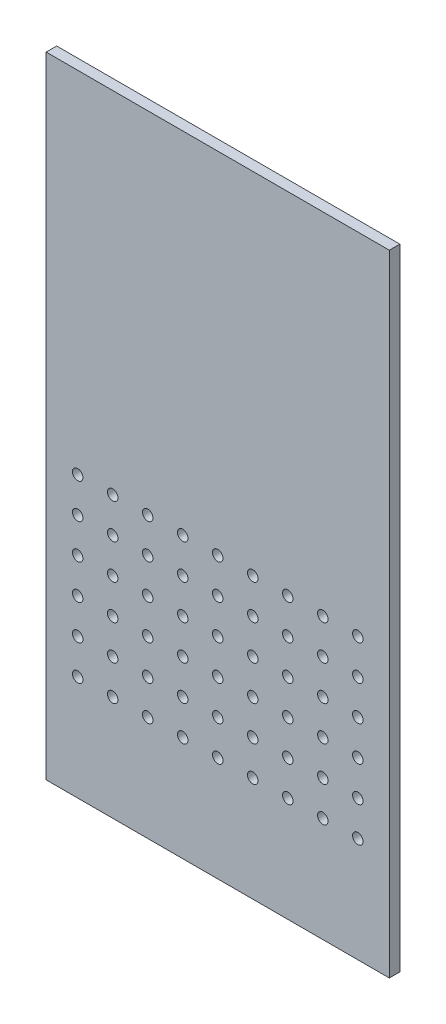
ISO-10303-21;
HEADER;
FILE_DESCRIPTION(('STEP AP214'),'2;1');
FILE_NAME('part.step','',(''),(''),'','','');
FILE_SCHEMA(('AUTOMOTIVE_DESIGN { 1 0 10303 214 1 1 1 1 }'));
ENDSEC;
DATA;
#1=APPLICATION_CONTEXT('core data for automotive mechanical design processes');
#2=APPLICATION_PROTOCOL_DEFINITION('international standard','automotive_design',2000,#1);
#3=PRODUCT_CONTEXT('',#1,'mechanical');
#4=PRODUCT('Part','Part','',(#3));
#5=PRODUCT_RELATED_PRODUCT_CATEGORY('part','',(#4));
#6=PRODUCT_DEFINITION_FORMATION('','',#4);
#7=PRODUCT_DEFINITION_CONTEXT('part definition',#1,'design');
#8=PRODUCT_DEFINITION('design','',#6,#7);
#9=PRODUCT_DEFINITION_SHAPE('','',#8);
#10=(LENGTH_UNIT() NAMED_UNIT(*) SI_UNIT(.MILLI.,.METRE.));
#11=(NAMED_UNIT(*) PLANE_ANGLE_UNIT() SI_UNIT($,.RADIAN.));
#12=(NAMED_UNIT(*) SI_UNIT($,.STERADIAN.) SOLID_ANGLE_UNIT());
#13=UNCERTAINTY_MEASURE_WITH_UNIT(LENGTH_MEASURE(1.E-05),#10,'distance_accuracy_value','');
#14=(GEOMETRIC_REPRESENTATION_CONTEXT(3) GLOBAL_UNCERTAINTY_ASSIGNED_CONTEXT((#13)) GLOBAL_UNIT_ASSIGNED_CONTEXT((#10,
#11,#12)) REPRESENTATION_CONTEXT('',''));
#15=CARTESIAN_POINT('',(0.,0.,0.));
#16=DIRECTION('',(0.,0.,1.));
#17=DIRECTION('',(1.,0.,0.));
#18=AXIS2_PLACEMENT_3D('',#15,#16,#17);
#19=CARTESIAN_POINT('',(0.,0.,3.));
#20=DIRECTION('',(0.,0.,1.));
#21=DIRECTION('',(1.,0.,0.));
#22=AXIS2_PLACEMENT_3D('',#19,#20,#21);
#23=PLANE('',#22);
#24=CARTESIAN_POINT('',(-35.4486966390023,-4.46681415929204,3.));
#25=DIRECTION('',(0.,0.,1.));
#26=DIRECTION('',(1.,0.,0.));
#27=AXIS2_PLACEMENT_3D('',#24,#25,#26);
#28=CIRCLE('',#27,1.5);
#29=CARTESIAN_POINT('',(-33.9486966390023,-4.46681415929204,3.));
#30=VERTEX_POINT('',#29);
#31=EDGE_CURVE('E420',#30,#30,#28,.T.);
#32=ORIENTED_EDGE('',*,*,#31,.F.);
#33=EDGE_LOOP('',(#32));
#34=FACE_BOUND('',#33,.T.);
#35=CARTESIAN_POINT('',(34.5513033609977,5.53318584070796,3.));
#36=DIRECTION('',(0.,0.,1.));
#37=DIRECTION('',(1.,0.,0.));
#38=AXIS2_PLACEMENT_3D('',#35,#36,#37);
#39=CIRCLE('',#38,1.5);
#40=CARTESIAN_POINT('',(36.0513033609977,5.53318584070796,3.));
#41=VERTEX_POINT('',#40);
#42=EDGE_CURVE('E408',#41,#41,#39,.T.);
#43=ORIENTED_EDGE('',*,*,#42,.F.);
#44=EDGE_LOOP('',(#43));
#45=FACE_BOUND('',#44,.T.);
#46=CARTESIAN_POINT('',(14.5513033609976,5.53318584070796,3.));
#47=DIRECTION('',(0.,0.,1.));
#48=DIRECTION('',(1.,0.,0.));
#49=AXIS2_PLACEMENT_3D('',#46,#47,#48);
#50=CIRCLE('',#49,1.5);
#51=CARTESIAN_POINT('',(16.0513033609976,5.53318584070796,3.));
#52=VERTEX_POINT('',#51);
#53=EDGE_CURVE('E396',#52,#52,#50,.T.);
#54=ORIENTED_EDGE('',*,*,#53,.F.);
#55=EDGE_LOOP('',(#54));
#56=FACE_BOUND('',#55,.T.);
#57=CARTESIAN_POINT('',(-5.44869663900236,5.53318584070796,3.));
#58=DIRECTION('',(0.,0.,1.));
#59=DIRECTION('',(1.,0.,0.));
#60=AXIS2_PLACEMENT_3D('',#57,#58,#59);
#61=CIRCLE('',#60,1.5);
#62=CARTESIAN_POINT('',(-3.94869663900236,5.53318584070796,3.));
#63=VERTEX_POINT('',#62);
#64=EDGE_CURVE('E384',#63,#63,#61,.T.);
#65=ORIENTED_EDGE('',*,*,#64,.F.);
#66=EDGE_LOOP('',(#65));
#67=FACE_BOUND('',#66,.T.);
#68=CARTESIAN_POINT('',(-25.4486966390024,5.53318584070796,3.));
#69=DIRECTION('',(0.,0.,1.));
#70=DIRECTION('',(1.,0.,0.));
#71=AXIS2_PLACEMENT_3D('',#68,#69,#70);
#72=CIRCLE('',#71,1.5);
#73=CARTESIAN_POINT('',(-23.9486966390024,5.53318584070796,3.));
#74=VERTEX_POINT('',#73);
#75=EDGE_CURVE('E372',#74,#74,#72,.T.);
#76=ORIENTED_EDGE('',*,*,#75,.F.);
#77=EDGE_LOOP('',(#76));
#78=FACE_BOUND('',#77,.T.);
#79=CARTESIAN_POINT('',(-35.448696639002,-44.466814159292,3.));
#80=DIRECTION('',(0.,0.,1.));
#81=DIRECTION('',(1.,0.,0.));
#82=AXIS2_PLACEMENT_3D('',#79,#80,#81);
#83=CIRCLE('',#82,1.5);
#84=CARTESIAN_POINT('',(-33.948696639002,-44.466814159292,3.));
#85=VERTEX_POINT('',#84);
#86=EDGE_CURVE('E360',#85,#85,#83,.T.);
#87=ORIENTED_EDGE('',*,*,#86,.F.);
#88=EDGE_LOOP('',(#87));
#89=FACE_BOUND('',#88,.T.);
#90=CARTESIAN_POINT('',(34.5513033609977,-4.46681415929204,3.));
#91=DIRECTION('',(0.,0.,1.));
#92=DIRECTION('',(1.,0.,0.));
#93=AXIS2_PLACEMENT_3D('',#90,#91,#92);
#94=CIRCLE('',#93,1.5);
#95=CARTESIAN_POINT('',(36.0513033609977,-4.46681415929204,3.));
#96=VERTEX_POINT('',#95);
#97=EDGE_CURVE('E348',#96,#96,#94,.T.);
#98=ORIENTED_EDGE('',*,*,#97,.F.);
#99=EDGE_LOOP('',(#98));
#100=FACE_BOUND('',#99,.T.);
#101=CARTESIAN_POINT('',(14.5513033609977,-4.46681415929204,3.));
#102=DIRECTION('',(0.,0.,1.));
#103=DIRECTION('',(1.,0.,0.));
#104=AXIS2_PLACEMENT_3D('',#101,#102,#103);
#105=CIRCLE('',#104,1.5);
#106=CARTESIAN_POINT('',(16.0513033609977,-4.46681415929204,3.));
#107=VERTEX_POINT('',#106);
#108=EDGE_CURVE('E336',#107,#107,#105,.T.);
#109=ORIENTED_EDGE('',*,*,#108,.F.);
#110=EDGE_LOOP('',(#109));
#111=FACE_BOUND('',#110,.T.);
#112=CARTESIAN_POINT('',(-5.44869663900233,-4.46681415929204,3.));
#113=DIRECTION('',(0.,0.,1.));
#114=DIRECTION('',(1.,0.,0.));
#115=AXIS2_PLACEMENT_3D('',#112,#113,#114);
#116=CIRCLE('',#115,1.5);
#117=CARTESIAN_POINT('',(-3.94869663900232,-4.46681415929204,3.));
#118=VERTEX_POINT('',#117);
#119=EDGE_CURVE('E324',#118,#118,#116,.T.);
#120=ORIENTED_EDGE('',*,*,#119,.F.);
#121=EDGE_LOOP('',(#120));
#122=FACE_BOUND('',#121,.T.);
#123=CARTESIAN_POINT('',(-25.4486966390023,-4.46681415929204,3.));
#124=DIRECTION('',(0.,0.,1.));
#125=DIRECTION('',(1.,0.,0.));
#126=AXIS2_PLACEMENT_3D('',#123,#124,#125);
#127=CIRCLE('',#126,1.5);
#128=CARTESIAN_POINT('',(-23.9486966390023,-4.46681415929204,3.));
#129=VERTEX_POINT('',#128);
#130=EDGE_CURVE('E312',#129,#129,#127,.T.);
#131=ORIENTED_EDGE('',*,*,#130,.F.);
#132=EDGE_LOOP('',(#131));
#133=FACE_BOUND('',#132,.T.);
#134=CARTESIAN_POINT('',(34.5513033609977,-14.466814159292,3.));
#135=DIRECTION('',(0.,0.,1.));
#136=DIRECTION('',(1.,0.,0.));
#137=AXIS2_PLACEMENT_3D('',#134,#135,#136);
#138=CIRCLE('',#137,1.5);
#139=CARTESIAN_POINT('',(36.0513033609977,-14.466814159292,3.));
#140=VERTEX_POINT('',#139);
#141=EDGE_CURVE('E300',#140,#140,#138,.T.);
#142=ORIENTED_EDGE('',*,*,#141,.F.);
#143=EDGE_LOOP('',(#142));
#144=FACE_BOUND('',#143,.T.);
#145=CARTESIAN_POINT('',(14.5513033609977,-14.466814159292,3.));
#146=DIRECTION('',(0.,0.,1.));
#147=DIRECTION('',(1.,0.,0.));
#148=AXIS2_PLACEMENT_3D('',#145,#146,#147);
#149=CIRCLE('',#148,1.5);
#150=CARTESIAN_POINT('',(16.0513033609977,-14.466814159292,3.));
#151=VERTEX_POINT('',#150);
#152=EDGE_CURVE('E288',#151,#151,#149,.T.);
#153=ORIENTED_EDGE('',*,*,#152,.F.);
#154=EDGE_LOOP('',(#153));
#155=FACE_BOUND('',#154,.T.);
#156=CARTESIAN_POINT('',(-5.44869663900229,-14.466814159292,3.));
#157=DIRECTION('',(0.,0.,1.));
#158=DIRECTION('',(1.,0.,0.));
#159=AXIS2_PLACEMENT_3D('',#156,#157,#158);
#160=CIRCLE('',#159,1.5);
#161=CARTESIAN_POINT('',(-3.94869663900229,-14.466814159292,3.));
#162=VERTEX_POINT('',#161);
#163=EDGE_CURVE('E276',#162,#162,#160,.T.);
#164=ORIENTED_EDGE('',*,*,#163,.F.);
#165=EDGE_LOOP('',(#164));
#166=FACE_BOUND('',#165,.T.);
#167=CARTESIAN_POINT('',(-25.4486966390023,-14.466814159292,3.));
#168=DIRECTION('',(0.,0.,1.));
#169=DIRECTION('',(1.,0.,0.));
#170=AXIS2_PLACEMENT_3D('',#167,#168,#169);
#171=CIRCLE('',#170,1.5);
#172=CARTESIAN_POINT('',(-23.9486966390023,-14.466814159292,3.));
#173=VERTEX_POINT('',#172);
#174=EDGE_CURVE('E264',#173,#173,#171,.T.);
#175=ORIENTED_EDGE('',*,*,#174,.F.);
#176=EDGE_LOOP('',(#175));
#177=FACE_BOUND('',#176,.T.);
#178=CARTESIAN_POINT('',(44.5513033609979,-44.466814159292,3.));
#179=DIRECTION('',(0.,0.,1.));
#180=DIRECTION('',(1.,0.,0.));
#181=AXIS2_PLACEMENT_3D('',#178,#179,#180);
#182=CIRCLE('',#181,1.5);
#183=CARTESIAN_POINT('',(46.0513033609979,-44.466814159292,3.));
#184=VERTEX_POINT('',#183);
#185=EDGE_CURVE('E252',#184,#184,#182,.T.);
#186=ORIENTED_EDGE('',*,*,#185,.F.);
#187=EDGE_LOOP('',(#186));
#188=FACE_BOUND('',#187,.T.);
#189=CARTESIAN_POINT('',(24.5513033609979,-44.466814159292,3.));
#190=DIRECTION('',(0.,0.,1.));
#191=DIRECTION('',(1.,0.,0.));
#192=AXIS2_PLACEMENT_3D('',#189,#190,#191);
#193=CIRCLE('',#192,1.5);
#194=CARTESIAN_POINT('',(26.0513033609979,-44.466814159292,3.));
#195=VERTEX_POINT('',#194);
#196=EDGE_CURVE('E240',#195,#195,#193,.T.);
#197=ORIENTED_EDGE('',*,*,#196,.F.);
#198=EDGE_LOOP('',(#197));
#199=FACE_BOUND('',#198,.T.);
#200=CARTESIAN_POINT('',(4.55130336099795,-44.466814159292,3.));
#201=DIRECTION('',(0.,0.,1.));
#202=DIRECTION('',(1.,0.,0.));
#203=AXIS2_PLACEMENT_3D('',#200,#201,#202);
#204=CIRCLE('',#203,1.5);
#205=CARTESIAN_POINT('',(6.05130336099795,-44.466814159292,3.));
#206=VERTEX_POINT('',#205);
#207=EDGE_CURVE('E228',#206,#206,#204,.T.);
#208=ORIENTED_EDGE('',*,*,#207,.F.);
#209=EDGE_LOOP('',(#208));
#210=FACE_BOUND('',#209,.T.);
#211=CARTESIAN_POINT('',(-15.4486966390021,-44.466814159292,3.));
#212=DIRECTION('',(0.,0.,1.));
#213=DIRECTION('',(1.,0.,0.));
#214=AXIS2_PLACEMENT_3D('',#211,#212,#213);
#215=CIRCLE('',#214,1.5);
#216=CARTESIAN_POINT('',(-13.948696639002,-44.466814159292,3.));
#217=VERTEX_POINT('',#216);
#218=EDGE_CURVE('E216',#217,#217,#215,.T.);
#219=ORIENTED_EDGE('',*,*,#218,.F.);
#220=EDGE_LOOP('',(#219));
#221=FACE_BOUND('',#220,.T.);
#222=CARTESIAN_POINT('',(44.5513033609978,-34.466814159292,3.));
#223=DIRECTION('',(0.,0.,1.));
#224=DIRECTION('',(1.,0.,0.));
#225=AXIS2_PLACEMENT_3D('',#222,#223,#224);
#226=CIRCLE('',#225,1.5);
#227=CARTESIAN_POINT('',(46.0513033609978,-34.466814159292,3.));
#228=VERTEX_POINT('',#227);
#229=EDGE_CURVE('E204',#228,#228,#226,.T.);
#230=ORIENTED_EDGE('',*,*,#229,.F.);
#231=EDGE_LOOP('',(#230));
#232=FACE_BOUND('',#231,.T.);
#233=CARTESIAN_POINT('',(24.5513033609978,-34.466814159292,3.));
#234=DIRECTION('',(0.,0.,1.));
#235=DIRECTION('',(1.,0.,0.));
#236=AXIS2_PLACEMENT_3D('',#233,#234,#235);
#237=CIRCLE('',#236,1.5);
#238=CARTESIAN_POINT('',(26.0513033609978,-34.466814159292,3.));
#239=VERTEX_POINT('',#238);
#240=EDGE_CURVE('E192',#239,#239,#237,.T.);
#241=ORIENTED_EDGE('',*,*,#240,.F.);
#242=EDGE_LOOP('',(#241));
#243=FACE_BOUND('',#242,.T.);
#244=CARTESIAN_POINT('',(4.55130336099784,-34.466814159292,3.));
#245=DIRECTION('',(0.,0.,1.));
#246=DIRECTION('',(1.,0.,0.));
#247=AXIS2_PLACEMENT_3D('',#244,#245,#246);
#248=CIRCLE('',#247,1.5);
#249=CARTESIAN_POINT('',(6.05130336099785,-34.466814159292,3.));
#250=VERTEX_POINT('',#249);
#251=EDGE_CURVE('E180',#250,#250,#248,.T.);
#252=ORIENTED_EDGE('',*,*,#251,.F.);
#253=EDGE_LOOP('',(#252));
#254=FACE_BOUND('',#253,.T.);
#255=CARTESIAN_POINT('',(-15.4486966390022,-34.466814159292,3.));
#256=DIRECTION('',(0.,0.,1.));
#257=DIRECTION('',(1.,0.,0.));
#258=AXIS2_PLACEMENT_3D('',#255,#256,#257);
#259=CIRCLE('',#258,1.5);
#260=CARTESIAN_POINT('',(-13.9486966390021,-34.466814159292,3.));
#261=VERTEX_POINT('',#260);
#262=EDGE_CURVE('E168',#261,#261,#259,.T.);
#263=ORIENTED_EDGE('',*,*,#262,.F.);
#264=EDGE_LOOP('',(#263));
#265=FACE_BOUND('',#264,.T.);
#266=CARTESIAN_POINT('',(44.5513033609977,-24.466814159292,3.));
#267=DIRECTION('',(0.,0.,1.));
#268=DIRECTION('',(1.,0.,0.));
#269=AXIS2_PLACEMENT_3D('',#266,#267,#268);
#270=CIRCLE('',#269,1.5);
#271=CARTESIAN_POINT('',(46.0513033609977,-24.466814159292,3.));
#272=VERTEX_POINT('',#271);
#273=EDGE_CURVE('E156',#272,#272,#270,.T.);
#274=ORIENTED_EDGE('',*,*,#273,.F.);
#275=EDGE_LOOP('',(#274));
#276=FACE_BOUND('',#275,.T.);
#277=CARTESIAN_POINT('',(24.5513033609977,-24.466814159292,3.));
#278=DIRECTION('',(0.,0.,1.));
#279=DIRECTION('',(1.,0.,0.));
#280=AXIS2_PLACEMENT_3D('',#277,#278,#279);
#281=CIRCLE('',#280,1.5);
#282=CARTESIAN_POINT('',(26.0513033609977,-24.466814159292,3.));
#283=VERTEX_POINT('',#282);
#284=EDGE_CURVE('E144',#283,#283,#281,.T.);
#285=ORIENTED_EDGE('',*,*,#284,.F.);
#286=EDGE_LOOP('',(#285));
#287=FACE_BOUND('',#286,.T.);
#288=CARTESIAN_POINT('',(4.55130336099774,-24.466814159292,3.));
#289=DIRECTION('',(0.,0.,1.));
#290=DIRECTION('',(1.,0.,0.));
#291=AXIS2_PLACEMENT_3D('',#288,#289,#290);
#292=CIRCLE('',#291,1.5);
#293=CARTESIAN_POINT('',(6.05130336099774,-24.466814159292,3.));
#294=VERTEX_POINT('',#293);
#295=EDGE_CURVE('E132',#294,#294,#292,.T.);
#296=ORIENTED_EDGE('',*,*,#295,.F.);
#297=EDGE_LOOP('',(#296));
#298=FACE_BOUND('',#297,.T.);
#299=CARTESIAN_POINT('',(-15.4486966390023,-24.466814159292,3.));
#300=DIRECTION('',(0.,0.,1.));
#301=DIRECTION('',(1.,0.,0.));
#302=AXIS2_PLACEMENT_3D('',#299,#300,#301);
#303=CIRCLE('',#302,1.5);
#304=CARTESIAN_POINT('',(-13.9486966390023,-24.466814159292,3.));
#305=VERTEX_POINT('',#304);
#306=EDGE_CURVE('E120',#305,#305,#303,.T.);
#307=ORIENTED_EDGE('',*,*,#306,.F.);
#308=EDGE_LOOP('',(#307));
#309=FACE_BOUND('',#308,.T.);
#310=CARTESIAN_POINT('',(-35.4486966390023,-24.466814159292,3.));
#311=DIRECTION('',(0.,0.,1.));
#312=DIRECTION('',(1.,0.,0.));
#313=AXIS2_PLACEMENT_3D('',#310,#311,#312);
#314=CIRCLE('',#313,1.5);
#315=CARTESIAN_POINT('',(-33.9486966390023,-24.466814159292,3.));
#316=VERTEX_POINT('',#315);
#317=EDGE_CURVE('E99',#316,#316,#314,.T.);
#318=ORIENTED_EDGE('',*,*,#317,.F.);
#319=EDGE_LOOP('',(#318));
#320=FACE_BOUND('',#319,.T.);
#321=DIRECTION('',(0.,-1.,0.));
#322=VECTOR('',#321,1.);
#323=CARTESIAN_POINT('',(-44.4486966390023,105.533185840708,3.));
#324=LINE('',#323,#322);
#325=CARTESIAN_POINT('',(-44.4486966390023,105.533185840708,3.));
#326=VERTEX_POINT('',#325);
#327=CARTESIAN_POINT('',(-44.4486966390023,-74.466814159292,3.));
#328=VERTEX_POINT('',#327);
#329=EDGE_CURVE('E84',#326,#328,#324,.T.);
#330=ORIENTED_EDGE('',*,*,#329,.T.);
#331=DIRECTION('',(1.,0.,0.));
#332=VECTOR('',#331,1.);
#333=CARTESIAN_POINT('',(-44.4486966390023,-74.466814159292,3.));
#334=LINE('',#333,#332);
#335=CARTESIAN_POINT('',(53.5513033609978,-74.466814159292,3.));
#336=VERTEX_POINT('',#335);
#337=EDGE_CURVE('E79',#328,#336,#334,.T.);
#338=ORIENTED_EDGE('',*,*,#337,.T.);
#339=DIRECTION('',(0.,1.,0.));
#340=VECTOR('',#339,1.);
#341=CARTESIAN_POINT('',(53.5513033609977,105.533185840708,3.));
#342=LINE('',#341,#340);
#343=CARTESIAN_POINT('',(53.5513033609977,105.533185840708,3.));
#344=VERTEX_POINT('',#343);
#345=EDGE_CURVE('E82',#336,#344,#342,.T.);
#346=ORIENTED_EDGE('',*,*,#345,.T.);
#347=DIRECTION('',(-1.,0.,0.));
#348=VECTOR('',#347,1.);
#349=CARTESIAN_POINT('',(-44.4486966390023,105.533185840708,3.));
#350=LINE('',#349,#348);
#351=EDGE_CURVE('E49',#344,#326,#350,.T.);
#352=ORIENTED_EDGE('',*,*,#351,.T.);
#353=EDGE_LOOP('',(#330,#338,#346,#352));
#354=FACE_BOUND('',#353,.T.);
#355=CARTESIAN_POINT('',(-25.4486966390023,-24.466814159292,3.));
#356=DIRECTION('',(0.,0.,1.));
#357=DIRECTION('',(1.,0.,0.));
#358=AXIS2_PLACEMENT_3D('',#355,#356,#357);
#359=CIRCLE('',#358,1.5);
#360=CARTESIAN_POINT('',(-23.9486966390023,-24.466814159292,3.));
#361=VERTEX_POINT('',#360);
#362=EDGE_CURVE('E114',#361,#361,#359,.T.);
#363=ORIENTED_EDGE('',*,*,#362,.F.);
#364=EDGE_LOOP('',(#363));
#365=FACE_BOUND('',#364,.T.);
#366=CARTESIAN_POINT('',(-5.44869663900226,-24.466814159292,3.));
#367=DIRECTION('',(0.,0.,1.));
#368=DIRECTION('',(1.,0.,0.));
#369=AXIS2_PLACEMENT_3D('',#366,#367,#368);
#370=CIRCLE('',#369,1.5);
#371=CARTESIAN_POINT('',(-3.94869663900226,-24.466814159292,3.));
#372=VERTEX_POINT('',#371);
#373=EDGE_CURVE('E126',#372,#372,#370,.T.);
#374=ORIENTED_EDGE('',*,*,#373,.F.);
#375=EDGE_LOOP('',(#374));
#376=FACE_BOUND('',#375,.T.);
#377=CARTESIAN_POINT('',(14.5513033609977,-24.466814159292,3.));
#378=DIRECTION('',(0.,0.,1.));
#379=DIRECTION('',(1.,0.,0.));
#380=AXIS2_PLACEMENT_3D('',#377,#378,#379);
#381=CIRCLE('',#380,1.5);
#382=CARTESIAN_POINT('',(16.0513033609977,-24.466814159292,3.));
#383=VERTEX_POINT('',#382);
#384=EDGE_CURVE('E138',#383,#383,#381,.T.);
#385=ORIENTED_EDGE('',*,*,#384,.F.);
#386=EDGE_LOOP('',(#385));
#387=FACE_BOUND('',#386,.T.);
#388=CARTESIAN_POINT('',(34.5513033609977,-24.466814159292,3.));
#389=DIRECTION('',(0.,0.,1.));
#390=DIRECTION('',(1.,0.,0.));
#391=AXIS2_PLACEMENT_3D('',#388,#389,#390);
#392=CIRCLE('',#391,1.5);
#393=CARTESIAN_POINT('',(36.0513033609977,-24.466814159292,3.));
#394=VERTEX_POINT('',#393);
#395=EDGE_CURVE('E150',#394,#394,#392,.T.);
#396=ORIENTED_EDGE('',*,*,#395,.F.);
#397=EDGE_LOOP('',(#396));
#398=FACE_BOUND('',#397,.T.);
#399=CARTESIAN_POINT('',(-25.4486966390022,-34.466814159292,3.));
#400=DIRECTION('',(0.,0.,1.));
#401=DIRECTION('',(1.,0.,0.));
#402=AXIS2_PLACEMENT_3D('',#399,#400,#401);
#403=CIRCLE('',#402,1.5);
#404=CARTESIAN_POINT('',(-23.9486966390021,-34.466814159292,3.));
#405=VERTEX_POINT('',#404);
#406=EDGE_CURVE('E162',#405,#405,#403,.T.);
#407=ORIENTED_EDGE('',*,*,#406,.F.);
#408=EDGE_LOOP('',(#407));
#409=FACE_BOUND('',#408,.T.);
#410=CARTESIAN_POINT('',(-5.44869663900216,-34.466814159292,3.));
#411=DIRECTION('',(0.,0.,1.));
#412=DIRECTION('',(1.,0.,0.));
#413=AXIS2_PLACEMENT_3D('',#410,#411,#412);
#414=CIRCLE('',#413,1.5);
#415=CARTESIAN_POINT('',(-3.94869663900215,-34.466814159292,3.));
#416=VERTEX_POINT('',#415);
#417=EDGE_CURVE('E174',#416,#416,#414,.T.);
#418=ORIENTED_EDGE('',*,*,#417,.F.);
#419=EDGE_LOOP('',(#418));
#420=FACE_BOUND('',#419,.T.);
#421=CARTESIAN_POINT('',(14.5513033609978,-34.466814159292,3.));
#422=DIRECTION('',(0.,0.,1.));
#423=DIRECTION('',(1.,0.,0.));
#424=AXIS2_PLACEMENT_3D('',#421,#422,#423);
#425=CIRCLE('',#424,1.5);
#426=CARTESIAN_POINT('',(16.0513033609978,-34.466814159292,3.));
#427=VERTEX_POINT('',#426);
#428=EDGE_CURVE('E186',#427,#427,#425,.T.);
#429=ORIENTED_EDGE('',*,*,#428,.F.);
#430=EDGE_LOOP('',(#429));
#431=FACE_BOUND('',#430,.T.);
#432=CARTESIAN_POINT('',(34.5513033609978,-34.466814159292,3.));
#433=DIRECTION('',(0.,0.,1.));
#434=DIRECTION('',(1.,0.,0.));
#435=AXIS2_PLACEMENT_3D('',#432,#433,#434);
#436=CIRCLE('',#435,1.5);
#437=CARTESIAN_POINT('',(36.0513033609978,-34.466814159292,3.));
#438=VERTEX_POINT('',#437);
#439=EDGE_CURVE('E198',#438,#438,#436,.T.);
#440=ORIENTED_EDGE('',*,*,#439,.F.);
#441=EDGE_LOOP('',(#440));
#442=FACE_BOUND('',#441,.T.);
#443=CARTESIAN_POINT('',(-25.448696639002,-44.466814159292,3.));
#444=DIRECTION('',(0.,0.,1.));
#445=DIRECTION('',(1.,0.,0.));
#446=AXIS2_PLACEMENT_3D('',#443,#444,#445);
#447=CIRCLE('',#446,1.5);
#448=CARTESIAN_POINT('',(-23.948696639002,-44.466814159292,3.));
#449=VERTEX_POINT('',#448);
#450=EDGE_CURVE('E210',#449,#449,#447,.T.);
#451=ORIENTED_EDGE('',*,*,#450,.F.);
#452=EDGE_LOOP('',(#451));
#453=FACE_BOUND('',#452,.T.);
#454=CARTESIAN_POINT('',(-5.44869663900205,-44.466814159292,3.));
#455=DIRECTION('',(0.,0.,1.));
#456=DIRECTION('',(1.,0.,0.));
#457=AXIS2_PLACEMENT_3D('',#454,#455,#456);
#458=CIRCLE('',#457,1.5);
#459=CARTESIAN_POINT('',(-3.94869663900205,-44.466814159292,3.));
#460=VERTEX_POINT('',#459);
#461=EDGE_CURVE('E222',#460,#460,#458,.T.);
#462=ORIENTED_EDGE('',*,*,#461,.F.);
#463=EDGE_LOOP('',(#462));
#464=FACE_BOUND('',#463,.T.);
#465=CARTESIAN_POINT('',(14.5513033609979,-44.466814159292,3.));
#466=DIRECTION('',(0.,0.,1.));
#467=DIRECTION('',(1.,0.,0.));
#468=AXIS2_PLACEMENT_3D('',#465,#466,#467);
#469=CIRCLE('',#468,1.5);
#470=CARTESIAN_POINT('',(16.0513033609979,-44.466814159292,3.));
#471=VERTEX_POINT('',#470);
#472=EDGE_CURVE('E234',#471,#471,#469,.T.);
#473=ORIENTED_EDGE('',*,*,#472,.F.);
#474=EDGE_LOOP('',(#473));
#475=FACE_BOUND('',#474,.T.);
#476=CARTESIAN_POINT('',(34.5513033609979,-44.466814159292,3.));
#477=DIRECTION('',(0.,0.,1.));
#478=DIRECTION('',(1.,0.,0.));
#479=AXIS2_PLACEMENT_3D('',#476,#477,#478);
#480=CIRCLE('',#479,1.5);
#481=CARTESIAN_POINT('',(36.0513033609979,-44.466814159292,3.));
#482=VERTEX_POINT('',#481);
#483=EDGE_CURVE('E246',#482,#482,#480,.T.);
#484=ORIENTED_EDGE('',*,*,#483,.F.);
#485=EDGE_LOOP('',(#484));
#486=FACE_BOUND('',#485,.T.);
#487=CARTESIAN_POINT('',(-35.4486966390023,-14.466814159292,3.));
#488=DIRECTION('',(0.,0.,1.));
#489=DIRECTION('',(1.,0.,0.));
#490=AXIS2_PLACEMENT_3D('',#487,#488,#489);
#491=CIRCLE('',#490,1.5);
#492=CARTESIAN_POINT('',(-33.9486966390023,-14.466814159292,3.));
#493=VERTEX_POINT('',#492);
#494=EDGE_CURVE('E258',#493,#493,#491,.T.);
#495=ORIENTED_EDGE('',*,*,#494,.F.);
#496=EDGE_LOOP('',(#495));
#497=FACE_BOUND('',#496,.T.);
#498=CARTESIAN_POINT('',(-15.4486966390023,-14.466814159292,3.));
#499=DIRECTION('',(0.,0.,1.));
#500=DIRECTION('',(1.,0.,0.));
#501=AXIS2_PLACEMENT_3D('',#498,#499,#500);
#502=CIRCLE('',#501,1.5);
#503=CARTESIAN_POINT('',(-13.9486966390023,-14.466814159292,3.));
#504=VERTEX_POINT('',#503);
#505=EDGE_CURVE('E270',#504,#504,#502,.T.);
#506=ORIENTED_EDGE('',*,*,#505,.F.);
#507=EDGE_LOOP('',(#506));
#508=FACE_BOUND('',#507,.T.);
#509=CARTESIAN_POINT('',(4.55130336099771,-14.466814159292,3.));
#510=DIRECTION('',(0.,0.,1.));
#511=DIRECTION('',(1.,0.,0.));
#512=AXIS2_PLACEMENT_3D('',#509,#510,#511);
#513=CIRCLE('',#512,1.5);
#514=CARTESIAN_POINT('',(6.05130336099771,-14.466814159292,3.));
#515=VERTEX_POINT('',#514);
#516=EDGE_CURVE('E282',#515,#515,#513,.T.);
#517=ORIENTED_EDGE('',*,*,#516,.F.);
#518=EDGE_LOOP('',(#517));
#519=FACE_BOUND('',#518,.T.);
#520=CARTESIAN_POINT('',(24.5513033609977,-14.466814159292,3.));
#521=DIRECTION('',(0.,0.,1.));
#522=DIRECTION('',(1.,0.,0.));
#523=AXIS2_PLACEMENT_3D('',#520,#521,#522);
#524=CIRCLE('',#523,1.5);
#525=CARTESIAN_POINT('',(26.0513033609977,-14.466814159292,3.));
#526=VERTEX_POINT('',#525);
#527=EDGE_CURVE('E294',#526,#526,#524,.T.);
#528=ORIENTED_EDGE('',*,*,#527,.F.);
#529=EDGE_LOOP('',(#528));
#530=FACE_BOUND('',#529,.T.);
#531=CARTESIAN_POINT('',(44.5513033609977,-14.466814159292,3.));
#532=DIRECTION('',(0.,0.,1.));
#533=DIRECTION('',(1.,0.,0.));
#534=AXIS2_PLACEMENT_3D('',#531,#532,#533);
#535=CIRCLE('',#534,1.5);
#536=CARTESIAN_POINT('',(46.0513033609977,-14.466814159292,3.));
#537=VERTEX_POINT('',#536);
#538=EDGE_CURVE('E306',#537,#537,#535,.T.);
#539=ORIENTED_EDGE('',*,*,#538,.F.);
#540=EDGE_LOOP('',(#539));
#541=FACE_BOUND('',#540,.T.);
#542=CARTESIAN_POINT('',(-15.4486966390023,-4.46681415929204,3.));
#543=DIRECTION('',(0.,0.,1.));
#544=DIRECTION('',(1.,0.,0.));
#545=AXIS2_PLACEMENT_3D('',#542,#543,#544);
#546=CIRCLE('',#545,1.5);
#547=CARTESIAN_POINT('',(-13.9486966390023,-4.46681415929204,3.));
#548=VERTEX_POINT('',#547);
#549=EDGE_CURVE('E318',#548,#548,#546,.T.);
#550=ORIENTED_EDGE('',*,*,#549,.F.);
#551=EDGE_LOOP('',(#550));
#552=FACE_BOUND('',#551,.T.);
#553=CARTESIAN_POINT('',(4.55130336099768,-4.46681415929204,3.));
#554=DIRECTION('',(0.,0.,1.));
#555=DIRECTION('',(1.,0.,0.));
#556=AXIS2_PLACEMENT_3D('',#553,#554,#555);
#557=CIRCLE('',#556,1.5);
#558=CARTESIAN_POINT('',(6.05130336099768,-4.46681415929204,3.));
#559=VERTEX_POINT('',#558);
#560=EDGE_CURVE('E330',#559,#559,#557,.T.);
#561=ORIENTED_EDGE('',*,*,#560,.F.);
#562=EDGE_LOOP('',(#561));
#563=FACE_BOUND('',#562,.T.);
#564=CARTESIAN_POINT('',(24.5513033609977,-4.46681415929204,3.));
#565=DIRECTION('',(0.,0.,1.));
#566=DIRECTION('',(1.,0.,0.));
#567=AXIS2_PLACEMENT_3D('',#564,#565,#566);
#568=CIRCLE('',#567,1.5);
#569=CARTESIAN_POINT('',(26.0513033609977,-4.46681415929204,3.));
#570=VERTEX_POINT('',#569);
#571=EDGE_CURVE('E342',#570,#570,#568,.T.);
#572=ORIENTED_EDGE('',*,*,#571,.F.);
#573=EDGE_LOOP('',(#572));
#574=FACE_BOUND('',#573,.T.);
#575=CARTESIAN_POINT('',(-35.4486966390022,-34.466814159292,3.));
#576=DIRECTION('',(0.,0.,1.));
#577=DIRECTION('',(1.,0.,0.));
#578=AXIS2_PLACEMENT_3D('',#575,#576,#577);
#579=CIRCLE('',#578,1.5);
#580=CARTESIAN_POINT('',(-33.9486966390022,-34.466814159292,3.));
#581=VERTEX_POINT('',#580);
#582=EDGE_CURVE('E354',#581,#581,#579,.T.);
#583=ORIENTED_EDGE('',*,*,#582,.F.);
#584=EDGE_LOOP('',(#583));
#585=FACE_BOUND('',#584,.T.);
#586=CARTESIAN_POINT('',(44.5513033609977,-4.46681415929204,3.));
#587=DIRECTION('',(0.,0.,1.));
#588=DIRECTION('',(1.,0.,0.));
#589=AXIS2_PLACEMENT_3D('',#586,#587,#588);
#590=CIRCLE('',#589,1.5);
#591=CARTESIAN_POINT('',(46.0513033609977,-4.46681415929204,3.));
#592=VERTEX_POINT('',#591);
#593=EDGE_CURVE('E366',#592,#592,#590,.T.);
#594=ORIENTED_EDGE('',*,*,#593,.F.);
#595=EDGE_LOOP('',(#594));
#596=FACE_BOUND('',#595,.T.);
#597=CARTESIAN_POINT('',(-15.4486966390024,5.53318584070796,3.));
#598=DIRECTION('',(0.,0.,1.));
#599=DIRECTION('',(1.,0.,0.));
#600=AXIS2_PLACEMENT_3D('',#597,#598,#599);
#601=CIRCLE('',#600,1.5);
#602=CARTESIAN_POINT('',(-13.9486966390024,5.53318584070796,3.));
#603=VERTEX_POINT('',#602);
#604=EDGE_CURVE('E378',#603,#603,#601,.T.);
#605=ORIENTED_EDGE('',*,*,#604,.F.);
#606=EDGE_LOOP('',(#605));
#607=FACE_BOUND('',#606,.T.);
#608=CARTESIAN_POINT('',(4.55130336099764,5.53318584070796,3.));
#609=DIRECTION('',(0.,0.,1.));
#610=DIRECTION('',(1.,0.,0.));
#611=AXIS2_PLACEMENT_3D('',#608,#609,#610);
#612=CIRCLE('',#611,1.5);
#613=CARTESIAN_POINT('',(6.05130336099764,5.53318584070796,3.));
#614=VERTEX_POINT('',#613);
#615=EDGE_CURVE('E390',#614,#614,#612,.T.);
#616=ORIENTED_EDGE('',*,*,#615,.F.);
#617=EDGE_LOOP('',(#616));
#618=FACE_BOUND('',#617,.T.);
#619=CARTESIAN_POINT('',(24.5513033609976,5.53318584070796,3.));
#620=DIRECTION('',(0.,0.,1.));
#621=DIRECTION('',(1.,0.,0.));
#622=AXIS2_PLACEMENT_3D('',#619,#620,#621);
#623=CIRCLE('',#622,1.5);
#624=CARTESIAN_POINT('',(26.0513033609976,5.53318584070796,3.));
#625=VERTEX_POINT('',#624);
#626=EDGE_CURVE('E402',#625,#625,#623,.T.);
#627=ORIENTED_EDGE('',*,*,#626,.F.);
#628=EDGE_LOOP('',(#627));
#629=FACE_BOUND('',#628,.T.);
#630=CARTESIAN_POINT('',(44.5513033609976,5.53318584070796,3.));
#631=DIRECTION('',(0.,0.,1.));
#632=DIRECTION('',(1.,0.,0.));
#633=AXIS2_PLACEMENT_3D('',#630,#631,#632);
#634=CIRCLE('',#633,1.5);
#635=CARTESIAN_POINT('',(46.0513033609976,5.53318584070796,3.));
#636=VERTEX_POINT('',#635);
#637=EDGE_CURVE('E414',#636,#636,#634,.T.);
#638=ORIENTED_EDGE('',*,*,#637,.F.);
#639=EDGE_LOOP('',(#638));
#640=FACE_BOUND('',#639,.T.);
#641=CARTESIAN_POINT('',(-35.4486966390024,5.53318584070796,3.));
#642=DIRECTION('',(0.,0.,1.));
#643=DIRECTION('',(1.,0.,0.));
#644=AXIS2_PLACEMENT_3D('',#641,#642,#643);
#645=CIRCLE('',#644,1.5);
#646=CARTESIAN_POINT('',(-33.9486966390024,5.53318584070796,3.));
#647=VERTEX_POINT('',#646);
#648=EDGE_CURVE('E426',#647,#647,#645,.T.);
#649=ORIENTED_EDGE('',*,*,#648,.F.);
#650=EDGE_LOOP('',(#649));
#651=FACE_BOUND('',#650,.T.);
#652=ADVANCED_FACE('F32',(#34,#45,#56,#67,#78,#89,#100,#111,#122,#133,#144,#155,#166,#177,#188,
#199,#210,#221,#232,#243,#254,#265,#276,#287,#298,#309,#320,#354,#365,#376,#387,#398,#409,#420,
#431,#442,#453,#464,#475,#486,#497,#508,#519,#530,#541,#552,#563,#574,#585,#596,#607,#618,#629,
#640,#651),#23,.T.);
#653=CARTESIAN_POINT('',(0.,0.,0.));
#654=DIRECTION('',(0.,0.,1.));
#655=DIRECTION('',(1.,0.,0.));
#656=AXIS2_PLACEMENT_3D('',#653,#654,#655);
#657=PLANE('',#656);
#658=DIRECTION('',(0.,-1.,0.));
#659=VECTOR('',#658,1.);
#660=CARTESIAN_POINT('',(-44.4486966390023,105.533185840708,0.));
#661=LINE('',#660,#659);
#662=CARTESIAN_POINT('',(-44.4486966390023,105.533185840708,0.));
#663=VERTEX_POINT('',#662);
#664=CARTESIAN_POINT('',(-44.4486966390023,-74.466814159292,0.));
#665=VERTEX_POINT('',#664);
#666=EDGE_CURVE('E96',#663,#665,#661,.T.);
#667=ORIENTED_EDGE('',*,*,#666,.F.);
#668=DIRECTION('',(-1.,0.,0.));
#669=VECTOR('',#668,1.);
#670=CARTESIAN_POINT('',(-44.4486966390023,105.533185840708,0.));
#671=LINE('',#670,#669);
#672=CARTESIAN_POINT('',(53.5513033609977,105.533185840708,0.));
#673=VERTEX_POINT('',#672);
#674=EDGE_CURVE('E72',#673,#663,#671,.T.);
#675=ORIENTED_EDGE('',*,*,#674,.F.);
#676=DIRECTION('',(0.,1.,0.));
#677=VECTOR('',#676,1.);
#678=CARTESIAN_POINT('',(53.5513033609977,105.533185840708,0.));
#679=LINE('',#678,#677);
#680=CARTESIAN_POINT('',(53.5513033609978,-74.466814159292,0.));
#681=VERTEX_POINT('',#680);
#682=EDGE_CURVE('E66',#681,#673,#679,.T.);
#683=ORIENTED_EDGE('',*,*,#682,.F.);
#684=DIRECTION('',(1.,0.,0.));
#685=VECTOR('',#684,1.);
#686=CARTESIAN_POINT('',(-44.4486966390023,-74.466814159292,0.));
#687=LINE('',#686,#685);
#688=EDGE_CURVE('E88',#665,#681,#687,.T.);
#689=ORIENTED_EDGE('',*,*,#688,.F.);
#690=EDGE_LOOP('',(#667,#675,#683,#689));
#691=FACE_BOUND('',#690,.T.);
#692=CARTESIAN_POINT('',(-35.4486966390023,-24.466814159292,0.));
#693=DIRECTION('',(0.,0.,1.));
#694=DIRECTION('',(1.,0.,0.));
#695=AXIS2_PLACEMENT_3D('',#692,#693,#694);
#696=CIRCLE('',#695,1.5);
#697=CARTESIAN_POINT('',(-33.9486966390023,-24.466814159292,0.));
#698=VERTEX_POINT('',#697);
#699=EDGE_CURVE('E111',#698,#698,#696,.T.);
#700=ORIENTED_EDGE('',*,*,#699,.T.);
#701=EDGE_LOOP('',(#700));
#702=FACE_BOUND('',#701,.T.);
#703=CARTESIAN_POINT('',(-25.4486966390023,-24.466814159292,0.));
#704=DIRECTION('',(0.,0.,1.));
#705=DIRECTION('',(1.,0.,0.));
#706=AXIS2_PLACEMENT_3D('',#703,#704,#705);
#707=CIRCLE('',#706,1.5);
#708=CARTESIAN_POINT('',(-23.9486966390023,-24.466814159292,0.));
#709=VERTEX_POINT('',#708);
#710=EDGE_CURVE('E117',#709,#709,#707,.T.);
#711=ORIENTED_EDGE('',*,*,#710,.T.);
#712=EDGE_LOOP('',(#711));
#713=FACE_BOUND('',#712,.T.);
#714=CARTESIAN_POINT('',(-15.4486966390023,-24.466814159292,0.));
#715=DIRECTION('',(0.,0.,1.));
#716=DIRECTION('',(1.,0.,0.));
#717=AXIS2_PLACEMENT_3D('',#714,#715,#716);
#718=CIRCLE('',#717,1.5);
#719=CARTESIAN_POINT('',(-13.9486966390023,-24.466814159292,0.));
#720=VERTEX_POINT('',#719);
#721=EDGE_CURVE('E123',#720,#720,#718,.T.);
#722=ORIENTED_EDGE('',*,*,#721,.T.);
#723=EDGE_LOOP('',(#722));
#724=FACE_BOUND('',#723,.T.);
#725=CARTESIAN_POINT('',(-5.44869663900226,-24.466814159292,0.));
#726=DIRECTION('',(0.,0.,1.));
#727=DIRECTION('',(1.,0.,0.));
#728=AXIS2_PLACEMENT_3D('',#725,#726,#727);
#729=CIRCLE('',#728,1.5);
#730=CARTESIAN_POINT('',(-3.94869663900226,-24.466814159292,0.));
#731=VERTEX_POINT('',#730);
#732=EDGE_CURVE('E129',#731,#731,#729,.T.);
#733=ORIENTED_EDGE('',*,*,#732,.T.);
#734=EDGE_LOOP('',(#733));
#735=FACE_BOUND('',#734,.T.);
#736=CARTESIAN_POINT('',(4.55130336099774,-24.466814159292,0.));
#737=DIRECTION('',(0.,0.,1.));
#738=DIRECTION('',(1.,0.,0.));
#739=AXIS2_PLACEMENT_3D('',#736,#737,#738);
#740=CIRCLE('',#739,1.5);
#741=CARTESIAN_POINT('',(6.05130336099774,-24.466814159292,0.));
#742=VERTEX_POINT('',#741);
#743=EDGE_CURVE('E135',#742,#742,#740,.T.);
#744=ORIENTED_EDGE('',*,*,#743,.T.);
#745=EDGE_LOOP('',(#744));
#746=FACE_BOUND('',#745,.T.);
#747=CARTESIAN_POINT('',(14.5513033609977,-24.466814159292,0.));
#748=DIRECTION('',(0.,0.,1.));
#749=DIRECTION('',(1.,0.,0.));
#750=AXIS2_PLACEMENT_3D('',#747,#748,#749);
#751=CIRCLE('',#750,1.5);
#752=CARTESIAN_POINT('',(16.0513033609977,-24.466814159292,0.));
#753=VERTEX_POINT('',#752);
#754=EDGE_CURVE('E141',#753,#753,#751,.T.);
#755=ORIENTED_EDGE('',*,*,#754,.T.);
#756=EDGE_LOOP('',(#755));
#757=FACE_BOUND('',#756,.T.);
#758=CARTESIAN_POINT('',(24.5513033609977,-24.466814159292,0.));
#759=DIRECTION('',(0.,0.,1.));
#760=DIRECTION('',(1.,0.,0.));
#761=AXIS2_PLACEMENT_3D('',#758,#759,#760);
#762=CIRCLE('',#761,1.5);
#763=CARTESIAN_POINT('',(26.0513033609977,-24.466814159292,0.));
#764=VERTEX_POINT('',#763);
#765=EDGE_CURVE('E147',#764,#764,#762,.T.);
#766=ORIENTED_EDGE('',*,*,#765,.T.);
#767=EDGE_LOOP('',(#766));
#768=FACE_BOUND('',#767,.T.);
#769=CARTESIAN_POINT('',(34.5513033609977,-24.466814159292,0.));
#770=DIRECTION('',(0.,0.,1.));
#771=DIRECTION('',(1.,0.,0.));
#772=AXIS2_PLACEMENT_3D('',#769,#770,#771);
#773=CIRCLE('',#772,1.5);
#774=CARTESIAN_POINT('',(36.0513033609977,-24.466814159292,0.));
#775=VERTEX_POINT('',#774);
#776=EDGE_CURVE('E153',#775,#775,#773,.T.);
#777=ORIENTED_EDGE('',*,*,#776,.T.);
#778=EDGE_LOOP('',(#777));
#779=FACE_BOUND('',#778,.T.);
#780=CARTESIAN_POINT('',(44.5513033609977,-24.466814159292,0.));
#781=DIRECTION('',(0.,0.,1.));
#782=DIRECTION('',(1.,0.,0.));
#783=AXIS2_PLACEMENT_3D('',#780,#781,#782);
#784=CIRCLE('',#783,1.5);
#785=CARTESIAN_POINT('',(46.0513033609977,-24.466814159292,0.));
#786=VERTEX_POINT('',#785);
#787=EDGE_CURVE('E159',#786,#786,#784,.T.);
#788=ORIENTED_EDGE('',*,*,#787,.T.);
#789=EDGE_LOOP('',(#788));
#790=FACE_BOUND('',#789,.T.);
#791=CARTESIAN_POINT('',(-25.4486966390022,-34.466814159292,0.));
#792=DIRECTION('',(0.,0.,1.));
#793=DIRECTION('',(1.,0.,0.));
#794=AXIS2_PLACEMENT_3D('',#791,#792,#793);
#795=CIRCLE('',#794,1.5);
#796=CARTESIAN_POINT('',(-23.9486966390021,-34.466814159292,0.));
#797=VERTEX_POINT('',#796);
#798=EDGE_CURVE('E165',#797,#797,#795,.T.);
#799=ORIENTED_EDGE('',*,*,#798,.T.);
#800=EDGE_LOOP('',(#799));
#801=FACE_BOUND('',#800,.T.);
#802=CARTESIAN_POINT('',(-15.4486966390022,-34.466814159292,0.));
#803=DIRECTION('',(0.,0.,1.));
#804=DIRECTION('',(1.,0.,0.));
#805=AXIS2_PLACEMENT_3D('',#802,#803,#804);
#806=CIRCLE('',#805,1.5);
#807=CARTESIAN_POINT('',(-13.9486966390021,-34.466814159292,0.));
#808=VERTEX_POINT('',#807);
#809=EDGE_CURVE('E171',#808,#808,#806,.T.);
#810=ORIENTED_EDGE('',*,*,#809,.T.);
#811=EDGE_LOOP('',(#810));
#812=FACE_BOUND('',#811,.T.);
#813=CARTESIAN_POINT('',(-5.44869663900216,-34.466814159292,0.));
#814=DIRECTION('',(0.,0.,1.));
#815=DIRECTION('',(1.,0.,0.));
#816=AXIS2_PLACEMENT_3D('',#813,#814,#815);
#817=CIRCLE('',#816,1.5);
#818=CARTESIAN_POINT('',(-3.94869663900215,-34.466814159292,0.));
#819=VERTEX_POINT('',#818);
#820=EDGE_CURVE('E177',#819,#819,#817,.T.);
#821=ORIENTED_EDGE('',*,*,#820,.T.);
#822=EDGE_LOOP('',(#821));
#823=FACE_BOUND('',#822,.T.);
#824=CARTESIAN_POINT('',(4.55130336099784,-34.466814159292,0.));
#825=DIRECTION('',(0.,0.,1.));
#826=DIRECTION('',(1.,0.,0.));
#827=AXIS2_PLACEMENT_3D('',#824,#825,#826);
#828=CIRCLE('',#827,1.5);
#829=CARTESIAN_POINT('',(6.05130336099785,-34.466814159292,0.));
#830=VERTEX_POINT('',#829);
#831=EDGE_CURVE('E183',#830,#830,#828,.T.);
#832=ORIENTED_EDGE('',*,*,#831,.T.);
#833=EDGE_LOOP('',(#832));
#834=FACE_BOUND('',#833,.T.);
#835=CARTESIAN_POINT('',(14.5513033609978,-34.466814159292,0.));
#836=DIRECTION('',(0.,0.,1.));
#837=DIRECTION('',(1.,0.,0.));
#838=AXIS2_PLACEMENT_3D('',#835,#836,#837);
#839=CIRCLE('',#838,1.5);
#840=CARTESIAN_POINT('',(16.0513033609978,-34.466814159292,0.));
#841=VERTEX_POINT('',#840);
#842=EDGE_CURVE('E189',#841,#841,#839,.T.);
#843=ORIENTED_EDGE('',*,*,#842,.T.);
#844=EDGE_LOOP('',(#843));
#845=FACE_BOUND('',#844,.T.);
#846=CARTESIAN_POINT('',(24.5513033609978,-34.466814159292,0.));
#847=DIRECTION('',(0.,0.,1.));
#848=DIRECTION('',(1.,0.,0.));
#849=AXIS2_PLACEMENT_3D('',#846,#847,#848);
#850=CIRCLE('',#849,1.5);
#851=CARTESIAN_POINT('',(26.0513033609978,-34.466814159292,0.));
#852=VERTEX_POINT('',#851);
#853=EDGE_CURVE('E195',#852,#852,#850,.T.);
#854=ORIENTED_EDGE('',*,*,#853,.T.);
#855=EDGE_LOOP('',(#854));
#856=FACE_BOUND('',#855,.T.);
#857=CARTESIAN_POINT('',(34.5513033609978,-34.466814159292,0.));
#858=DIRECTION('',(0.,0.,1.));
#859=DIRECTION('',(1.,0.,0.));
#860=AXIS2_PLACEMENT_3D('',#857,#858,#859);
#861=CIRCLE('',#860,1.5);
#862=CARTESIAN_POINT('',(36.0513033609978,-34.466814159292,0.));
#863=VERTEX_POINT('',#862);
#864=EDGE_CURVE('E201',#863,#863,#861,.T.);
#865=ORIENTED_EDGE('',*,*,#864,.T.);
#866=EDGE_LOOP('',(#865));
#867=FACE_BOUND('',#866,.T.);
#868=CARTESIAN_POINT('',(44.5513033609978,-34.466814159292,0.));
#869=DIRECTION('',(0.,0.,1.));
#870=DIRECTION('',(1.,0.,0.));
#871=AXIS2_PLACEMENT_3D('',#868,#869,#870);
#872=CIRCLE('',#871,1.5);
#873=CARTESIAN_POINT('',(46.0513033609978,-34.466814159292,0.));
#874=VERTEX_POINT('',#873);
#875=EDGE_CURVE('E207',#874,#874,#872,.T.);
#876=ORIENTED_EDGE('',*,*,#875,.T.);
#877=EDGE_LOOP('',(#876));
#878=FACE_BOUND('',#877,.T.);
#879=CARTESIAN_POINT('',(-25.448696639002,-44.466814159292,0.));
#880=DIRECTION('',(0.,0.,1.));
#881=DIRECTION('',(1.,0.,0.));
#882=AXIS2_PLACEMENT_3D('',#879,#880,#881);
#883=CIRCLE('',#882,1.5);
#884=CARTESIAN_POINT('',(-23.948696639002,-44.466814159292,0.));
#885=VERTEX_POINT('',#884);
#886=EDGE_CURVE('E213',#885,#885,#883,.T.);
#887=ORIENTED_EDGE('',*,*,#886,.T.);
#888=EDGE_LOOP('',(#887));
#889=FACE_BOUND('',#888,.T.);
#890=CARTESIAN_POINT('',(-15.4486966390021,-44.466814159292,0.));
#891=DIRECTION('',(0.,0.,1.));
#892=DIRECTION('',(1.,0.,0.));
#893=AXIS2_PLACEMENT_3D('',#890,#891,#892);
#894=CIRCLE('',#893,1.5);
#895=CARTESIAN_POINT('',(-13.948696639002,-44.466814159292,0.));
#896=VERTEX_POINT('',#895);
#897=EDGE_CURVE('E219',#896,#896,#894,.T.);
#898=ORIENTED_EDGE('',*,*,#897,.T.);
#899=EDGE_LOOP('',(#898));
#900=FACE_BOUND('',#899,.T.);
#901=CARTESIAN_POINT('',(-5.44869663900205,-44.466814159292,0.));
#902=DIRECTION('',(0.,0.,1.));
#903=DIRECTION('',(1.,0.,0.));
#904=AXIS2_PLACEMENT_3D('',#901,#902,#903);
#905=CIRCLE('',#904,1.5);
#906=CARTESIAN_POINT('',(-3.94869663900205,-44.466814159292,0.));
#907=VERTEX_POINT('',#906);
#908=EDGE_CURVE('E225',#907,#907,#905,.T.);
#909=ORIENTED_EDGE('',*,*,#908,.T.);
#910=EDGE_LOOP('',(#909));
#911=FACE_BOUND('',#910,.T.);
#912=CARTESIAN_POINT('',(4.55130336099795,-44.466814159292,0.));
#913=DIRECTION('',(0.,0.,1.));
#914=DIRECTION('',(1.,0.,0.));
#915=AXIS2_PLACEMENT_3D('',#912,#913,#914);
#916=CIRCLE('',#915,1.5);
#917=CARTESIAN_POINT('',(6.05130336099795,-44.466814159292,0.));
#918=VERTEX_POINT('',#917);
#919=EDGE_CURVE('E231',#918,#918,#916,.T.);
#920=ORIENTED_EDGE('',*,*,#919,.T.);
#921=EDGE_LOOP('',(#920));
#922=FACE_BOUND('',#921,.T.);
#923=CARTESIAN_POINT('',(14.5513033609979,-44.466814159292,0.));
#924=DIRECTION('',(0.,0.,1.));
#925=DIRECTION('',(1.,0.,0.));
#926=AXIS2_PLACEMENT_3D('',#923,#924,#925);
#927=CIRCLE('',#926,1.5);
#928=CARTESIAN_POINT('',(16.0513033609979,-44.466814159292,0.));
#929=VERTEX_POINT('',#928);
#930=EDGE_CURVE('E237',#929,#929,#927,.T.);
#931=ORIENTED_EDGE('',*,*,#930,.T.);
#932=EDGE_LOOP('',(#931));
#933=FACE_BOUND('',#932,.T.);
#934=CARTESIAN_POINT('',(24.5513033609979,-44.466814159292,0.));
#935=DIRECTION('',(0.,0.,1.));
#936=DIRECTION('',(1.,0.,0.));
#937=AXIS2_PLACEMENT_3D('',#934,#935,#936);
#938=CIRCLE('',#937,1.5);
#939=CARTESIAN_POINT('',(26.0513033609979,-44.466814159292,0.));
#940=VERTEX_POINT('',#939);
#941=EDGE_CURVE('E243',#940,#940,#938,.T.);
#942=ORIENTED_EDGE('',*,*,#941,.T.);
#943=EDGE_LOOP('',(#942));
#944=FACE_BOUND('',#943,.T.);
#945=CARTESIAN_POINT('',(34.5513033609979,-44.466814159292,0.));
#946=DIRECTION('',(0.,0.,1.));
#947=DIRECTION('',(1.,0.,0.));
#948=AXIS2_PLACEMENT_3D('',#945,#946,#947);
#949=CIRCLE('',#948,1.5);
#950=CARTESIAN_POINT('',(36.0513033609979,-44.466814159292,0.));
#951=VERTEX_POINT('',#950);
#952=EDGE_CURVE('E249',#951,#951,#949,.T.);
#953=ORIENTED_EDGE('',*,*,#952,.T.);
#954=EDGE_LOOP('',(#953));
#955=FACE_BOUND('',#954,.T.);
#956=CARTESIAN_POINT('',(44.5513033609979,-44.466814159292,0.));
#957=DIRECTION('',(0.,0.,1.));
#958=DIRECTION('',(1.,0.,0.));
#959=AXIS2_PLACEMENT_3D('',#956,#957,#958);
#960=CIRCLE('',#959,1.5);
#961=CARTESIAN_POINT('',(46.0513033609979,-44.466814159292,0.));
#962=VERTEX_POINT('',#961);
#963=EDGE_CURVE('E255',#962,#962,#960,.T.);
#964=ORIENTED_EDGE('',*,*,#963,.T.);
#965=EDGE_LOOP('',(#964));
#966=FACE_BOUND('',#965,.T.);
#967=CARTESIAN_POINT('',(-35.4486966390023,-14.466814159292,0.));
#968=DIRECTION('',(0.,0.,1.));
#969=DIRECTION('',(1.,0.,0.));
#970=AXIS2_PLACEMENT_3D('',#967,#968,#969);
#971=CIRCLE('',#970,1.5);
#972=CARTESIAN_POINT('',(-33.9486966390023,-14.466814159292,0.));
#973=VERTEX_POINT('',#972);
#974=EDGE_CURVE('E261',#973,#973,#971,.T.);
#975=ORIENTED_EDGE('',*,*,#974,.T.);
#976=EDGE_LOOP('',(#975));
#977=FACE_BOUND('',#976,.T.);
#978=CARTESIAN_POINT('',(-25.4486966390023,-14.466814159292,0.));
#979=DIRECTION('',(0.,0.,1.));
#980=DIRECTION('',(1.,0.,0.));
#981=AXIS2_PLACEMENT_3D('',#978,#979,#980);
#982=CIRCLE('',#981,1.5);
#983=CARTESIAN_POINT('',(-23.9486966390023,-14.466814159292,0.));
#984=VERTEX_POINT('',#983);
#985=EDGE_CURVE('E267',#984,#984,#982,.T.);
#986=ORIENTED_EDGE('',*,*,#985,.T.);
#987=EDGE_LOOP('',(#986));
#988=FACE_BOUND('',#987,.T.);
#989=CARTESIAN_POINT('',(-15.4486966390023,-14.466814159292,0.));
#990=DIRECTION('',(0.,0.,1.));
#991=DIRECTION('',(1.,0.,0.));
#992=AXIS2_PLACEMENT_3D('',#989,#990,#991);
#993=CIRCLE('',#992,1.5);
#994=CARTESIAN_POINT('',(-13.9486966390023,-14.466814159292,0.));
#995=VERTEX_POINT('',#994);
#996=EDGE_CURVE('E273',#995,#995,#993,.T.);
#997=ORIENTED_EDGE('',*,*,#996,.T.);
#998=EDGE_LOOP('',(#997));
#999=FACE_BOUND('',#998,.T.);
#1000=CARTESIAN_POINT('',(-5.44869663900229,-14.466814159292,0.));
#1001=DIRECTION('',(0.,0.,1.));
#1002=DIRECTION('',(1.,0.,0.));
#1003=AXIS2_PLACEMENT_3D('',#1000,#1001,#1002);
#1004=CIRCLE('',#1003,1.5);
#1005=CARTESIAN_POINT('',(-3.94869663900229,-14.466814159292,0.));
#1006=VERTEX_POINT('',#1005);
#1007=EDGE_CURVE('E279',#1006,#1006,#1004,.T.);
#1008=ORIENTED_EDGE('',*,*,#1007,.T.);
#1009=EDGE_LOOP('',(#1008));
#1010=FACE_BOUND('',#1009,.T.);
#1011=CARTESIAN_POINT('',(4.55130336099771,-14.466814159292,0.));
#1012=DIRECTION('',(0.,0.,1.));
#1013=DIRECTION('',(1.,0.,0.));
#1014=AXIS2_PLACEMENT_3D('',#1011,#1012,#1013);
#1015=CIRCLE('',#1014,1.5);
#1016=CARTESIAN_POINT('',(6.05130336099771,-14.466814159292,0.));
#1017=VERTEX_POINT('',#1016);
#1018=EDGE_CURVE('E285',#1017,#1017,#1015,.T.);
#1019=ORIENTED_EDGE('',*,*,#1018,.T.);
#1020=EDGE_LOOP('',(#1019));
#1021=FACE_BOUND('',#1020,.T.);
#1022=CARTESIAN_POINT('',(14.5513033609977,-14.466814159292,0.));
#1023=DIRECTION('',(0.,0.,1.));
#1024=DIRECTION('',(1.,0.,0.));
#1025=AXIS2_PLACEMENT_3D('',#1022,#1023,#1024);
#1026=CIRCLE('',#1025,1.5);
#1027=CARTESIAN_POINT('',(16.0513033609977,-14.466814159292,0.));
#1028=VERTEX_POINT('',#1027);
#1029=EDGE_CURVE('E291',#1028,#1028,#1026,.T.);
#1030=ORIENTED_EDGE('',*,*,#1029,.T.);
#1031=EDGE_LOOP('',(#1030));
#1032=FACE_BOUND('',#1031,.T.);
#1033=CARTESIAN_POINT('',(24.5513033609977,-14.466814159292,0.));
#1034=DIRECTION('',(0.,0.,1.));
#1035=DIRECTION('',(1.,0.,0.));
#1036=AXIS2_PLACEMENT_3D('',#1033,#1034,#1035);
#1037=CIRCLE('',#1036,1.5);
#1038=CARTESIAN_POINT('',(26.0513033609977,-14.466814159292,0.));
#1039=VERTEX_POINT('',#1038);
#1040=EDGE_CURVE('E297',#1039,#1039,#1037,.T.);
#1041=ORIENTED_EDGE('',*,*,#1040,.T.);
#1042=EDGE_LOOP('',(#1041));
#1043=FACE_BOUND('',#1042,.T.);
#1044=CARTESIAN_POINT('',(34.5513033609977,-14.466814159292,0.));
#1045=DIRECTION('',(0.,0.,1.));
#1046=DIRECTION('',(1.,0.,0.));
#1047=AXIS2_PLACEMENT_3D('',#1044,#1045,#1046);
#1048=CIRCLE('',#1047,1.5);
#1049=CARTESIAN_POINT('',(36.0513033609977,-14.466814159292,0.));
#1050=VERTEX_POINT('',#1049);
#1051=EDGE_CURVE('E303',#1050,#1050,#1048,.T.);
#1052=ORIENTED_EDGE('',*,*,#1051,.T.);
#1053=EDGE_LOOP('',(#1052));
#1054=FACE_BOUND('',#1053,.T.);
#1055=CARTESIAN_POINT('',(44.5513033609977,-14.466814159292,0.));
#1056=DIRECTION('',(0.,0.,1.));
#1057=DIRECTION('',(1.,0.,0.));
#1058=AXIS2_PLACEMENT_3D('',#1055,#1056,#1057);
#1059=CIRCLE('',#1058,1.5);
#1060=CARTESIAN_POINT('',(46.0513033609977,-14.466814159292,0.));
#1061=VERTEX_POINT('',#1060);
#1062=EDGE_CURVE('E309',#1061,#1061,#1059,.T.);
#1063=ORIENTED_EDGE('',*,*,#1062,.T.);
#1064=EDGE_LOOP('',(#1063));
#1065=FACE_BOUND('',#1064,.T.);
#1066=CARTESIAN_POINT('',(-25.4486966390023,-4.46681415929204,0.));
#1067=DIRECTION('',(0.,0.,1.));
#1068=DIRECTION('',(1.,0.,0.));
#1069=AXIS2_PLACEMENT_3D('',#1066,#1067,#1068);
#1070=CIRCLE('',#1069,1.5);
#1071=CARTESIAN_POINT('',(-23.9486966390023,-4.46681415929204,0.));
#1072=VERTEX_POINT('',#1071);
#1073=EDGE_CURVE('E315',#1072,#1072,#1070,.T.);
#1074=ORIENTED_EDGE('',*,*,#1073,.T.);
#1075=EDGE_LOOP('',(#1074));
#1076=FACE_BOUND('',#1075,.T.);
#1077=CARTESIAN_POINT('',(-15.4486966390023,-4.46681415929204,0.));
#1078=DIRECTION('',(0.,0.,1.));
#1079=DIRECTION('',(1.,0.,0.));
#1080=AXIS2_PLACEMENT_3D('',#1077,#1078,#1079);
#1081=CIRCLE('',#1080,1.5);
#1082=CARTESIAN_POINT('',(-13.9486966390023,-4.46681415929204,0.));
#1083=VERTEX_POINT('',#1082);
#1084=EDGE_CURVE('E321',#1083,#1083,#1081,.T.);
#1085=ORIENTED_EDGE('',*,*,#1084,.T.);
#1086=EDGE_LOOP('',(#1085));
#1087=FACE_BOUND('',#1086,.T.);
#1088=CARTESIAN_POINT('',(-5.44869663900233,-4.46681415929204,0.));
#1089=DIRECTION('',(0.,0.,1.));
#1090=DIRECTION('',(1.,0.,0.));
#1091=AXIS2_PLACEMENT_3D('',#1088,#1089,#1090);
#1092=CIRCLE('',#1091,1.5);
#1093=CARTESIAN_POINT('',(-3.94869663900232,-4.46681415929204,0.));
#1094=VERTEX_POINT('',#1093);
#1095=EDGE_CURVE('E327',#1094,#1094,#1092,.T.);
#1096=ORIENTED_EDGE('',*,*,#1095,.T.);
#1097=EDGE_LOOP('',(#1096));
#1098=FACE_BOUND('',#1097,.T.);
#1099=CARTESIAN_POINT('',(4.55130336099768,-4.46681415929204,0.));
#1100=DIRECTION('',(0.,0.,1.));
#1101=DIRECTION('',(1.,0.,0.));
#1102=AXIS2_PLACEMENT_3D('',#1099,#1100,#1101);
#1103=CIRCLE('',#1102,1.5);
#1104=CARTESIAN_POINT('',(6.05130336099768,-4.46681415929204,0.));
#1105=VERTEX_POINT('',#1104);
#1106=EDGE_CURVE('E333',#1105,#1105,#1103,.T.);
#1107=ORIENTED_EDGE('',*,*,#1106,.T.);
#1108=EDGE_LOOP('',(#1107));
#1109=FACE_BOUND('',#1108,.T.);
#1110=CARTESIAN_POINT('',(14.5513033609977,-4.46681415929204,0.));
#1111=DIRECTION('',(0.,0.,1.));
#1112=DIRECTION('',(1.,0.,0.));
#1113=AXIS2_PLACEMENT_3D('',#1110,#1111,#1112);
#1114=CIRCLE('',#1113,1.5);
#1115=CARTESIAN_POINT('',(16.0513033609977,-4.46681415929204,0.));
#1116=VERTEX_POINT('',#1115);
#1117=EDGE_CURVE('E339',#1116,#1116,#1114,.T.);
#1118=ORIENTED_EDGE('',*,*,#1117,.T.);
#1119=EDGE_LOOP('',(#1118));
#1120=FACE_BOUND('',#1119,.T.);
#1121=CARTESIAN_POINT('',(24.5513033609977,-4.46681415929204,0.));
#1122=DIRECTION('',(0.,0.,1.));
#1123=DIRECTION('',(1.,0.,0.));
#1124=AXIS2_PLACEMENT_3D('',#1121,#1122,#1123);
#1125=CIRCLE('',#1124,1.5);
#1126=CARTESIAN_POINT('',(26.0513033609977,-4.46681415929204,0.));
#1127=VERTEX_POINT('',#1126);
#1128=EDGE_CURVE('E345',#1127,#1127,#1125,.T.);
#1129=ORIENTED_EDGE('',*,*,#1128,.T.);
#1130=EDGE_LOOP('',(#1129));
#1131=FACE_BOUND('',#1130,.T.);
#1132=CARTESIAN_POINT('',(34.5513033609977,-4.46681415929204,0.));
#1133=DIRECTION('',(0.,0.,1.));
#1134=DIRECTION('',(1.,0.,0.));
#1135=AXIS2_PLACEMENT_3D('',#1132,#1133,#1134);
#1136=CIRCLE('',#1135,1.5);
#1137=CARTESIAN_POINT('',(36.0513033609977,-4.46681415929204,0.));
#1138=VERTEX_POINT('',#1137);
#1139=EDGE_CURVE('E351',#1138,#1138,#1136,.T.);
#1140=ORIENTED_EDGE('',*,*,#1139,.T.);
#1141=EDGE_LOOP('',(#1140));
#1142=FACE_BOUND('',#1141,.T.);
#1143=CARTESIAN_POINT('',(-35.4486966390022,-34.466814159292,0.));
#1144=DIRECTION('',(0.,0.,1.));
#1145=DIRECTION('',(1.,0.,0.));
#1146=AXIS2_PLACEMENT_3D('',#1143,#1144,#1145);
#1147=CIRCLE('',#1146,1.5);
#1148=CARTESIAN_POINT('',(-33.9486966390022,-34.466814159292,0.));
#1149=VERTEX_POINT('',#1148);
#1150=EDGE_CURVE('E357',#1149,#1149,#1147,.T.);
#1151=ORIENTED_EDGE('',*,*,#1150,.T.);
#1152=EDGE_LOOP('',(#1151));
#1153=FACE_BOUND('',#1152,.T.);
#1154=CARTESIAN_POINT('',(-35.448696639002,-44.466814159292,0.));
#1155=DIRECTION('',(0.,0.,1.));
#1156=DIRECTION('',(1.,0.,0.));
#1157=AXIS2_PLACEMENT_3D('',#1154,#1155,#1156);
#1158=CIRCLE('',#1157,1.5);
#1159=CARTESIAN_POINT('',(-33.948696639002,-44.466814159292,0.));
#1160=VERTEX_POINT('',#1159);
#1161=EDGE_CURVE('E363',#1160,#1160,#1158,.T.);
#1162=ORIENTED_EDGE('',*,*,#1161,.T.);
#1163=EDGE_LOOP('',(#1162));
#1164=FACE_BOUND('',#1163,.T.);
#1165=CARTESIAN_POINT('',(44.5513033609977,-4.46681415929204,0.));
#1166=DIRECTION('',(0.,0.,1.));
#1167=DIRECTION('',(1.,0.,0.));
#1168=AXIS2_PLACEMENT_3D('',#1165,#1166,#1167);
#1169=CIRCLE('',#1168,1.5);
#1170=CARTESIAN_POINT('',(46.0513033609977,-4.46681415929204,0.));
#1171=VERTEX_POINT('',#1170);
#1172=EDGE_CURVE('E369',#1171,#1171,#1169,.T.);
#1173=ORIENTED_EDGE('',*,*,#1172,.T.);
#1174=EDGE_LOOP('',(#1173));
#1175=FACE_BOUND('',#1174,.T.);
#1176=CARTESIAN_POINT('',(-25.4486966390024,5.53318584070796,0.));
#1177=DIRECTION('',(0.,0.,1.));
#1178=DIRECTION('',(1.,0.,0.));
#1179=AXIS2_PLACEMENT_3D('',#1176,#1177,#1178);
#1180=CIRCLE('',#1179,1.5);
#1181=CARTESIAN_POINT('',(-23.9486966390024,5.53318584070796,0.));
#1182=VERTEX_POINT('',#1181);
#1183=EDGE_CURVE('E375',#1182,#1182,#1180,.T.);
#1184=ORIENTED_EDGE('',*,*,#1183,.T.);
#1185=EDGE_LOOP('',(#1184));
#1186=FACE_BOUND('',#1185,.T.);
#1187=CARTESIAN_POINT('',(-15.4486966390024,5.53318584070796,0.));
#1188=DIRECTION('',(0.,0.,1.));
#1189=DIRECTION('',(1.,0.,0.));
#1190=AXIS2_PLACEMENT_3D('',#1187,#1188,#1189);
#1191=CIRCLE('',#1190,1.5);
#1192=CARTESIAN_POINT('',(-13.9486966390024,5.53318584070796,0.));
#1193=VERTEX_POINT('',#1192);
#1194=EDGE_CURVE('E381',#1193,#1193,#1191,.T.);
#1195=ORIENTED_EDGE('',*,*,#1194,.T.);
#1196=EDGE_LOOP('',(#1195));
#1197=FACE_BOUND('',#1196,.T.);
#1198=CARTESIAN_POINT('',(-5.44869663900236,5.53318584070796,0.));
#1199=DIRECTION('',(0.,0.,1.));
#1200=DIRECTION('',(1.,0.,0.));
#1201=AXIS2_PLACEMENT_3D('',#1198,#1199,#1200);
#1202=CIRCLE('',#1201,1.5);
#1203=CARTESIAN_POINT('',(-3.94869663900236,5.53318584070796,0.));
#1204=VERTEX_POINT('',#1203);
#1205=EDGE_CURVE('E387',#1204,#1204,#1202,.T.);
#1206=ORIENTED_EDGE('',*,*,#1205,.T.);
#1207=EDGE_LOOP('',(#1206));
#1208=FACE_BOUND('',#1207,.T.);
#1209=CARTESIAN_POINT('',(4.55130336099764,5.53318584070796,0.));
#1210=DIRECTION('',(0.,0.,1.));
#1211=DIRECTION('',(1.,0.,0.));
#1212=AXIS2_PLACEMENT_3D('',#1209,#1210,#1211);
#1213=CIRCLE('',#1212,1.5);
#1214=CARTESIAN_POINT('',(6.05130336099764,5.53318584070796,0.));
#1215=VERTEX_POINT('',#1214);
#1216=EDGE_CURVE('E393',#1215,#1215,#1213,.T.);
#1217=ORIENTED_EDGE('',*,*,#1216,.T.);
#1218=EDGE_LOOP('',(#1217));
#1219=FACE_BOUND('',#1218,.T.);
#1220=CARTESIAN_POINT('',(14.5513033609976,5.53318584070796,0.));
#1221=DIRECTION('',(0.,0.,1.));
#1222=DIRECTION('',(1.,0.,0.));
#1223=AXIS2_PLACEMENT_3D('',#1220,#1221,#1222);
#1224=CIRCLE('',#1223,1.5);
#1225=CARTESIAN_POINT('',(16.0513033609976,5.53318584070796,0.));
#1226=VERTEX_POINT('',#1225);
#1227=EDGE_CURVE('E399',#1226,#1226,#1224,.T.);
#1228=ORIENTED_EDGE('',*,*,#1227,.T.);
#1229=EDGE_LOOP('',(#1228));
#1230=FACE_BOUND('',#1229,.T.);
#1231=CARTESIAN_POINT('',(24.5513033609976,5.53318584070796,0.));
#1232=DIRECTION('',(0.,0.,1.));
#1233=DIRECTION('',(1.,0.,0.));
#1234=AXIS2_PLACEMENT_3D('',#1231,#1232,#1233);
#1235=CIRCLE('',#1234,1.5);
#1236=CARTESIAN_POINT('',(26.0513033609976,5.53318584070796,0.));
#1237=VERTEX_POINT('',#1236);
#1238=EDGE_CURVE('E405',#1237,#1237,#1235,.T.);
#1239=ORIENTED_EDGE('',*,*,#1238,.T.);
#1240=EDGE_LOOP('',(#1239));
#1241=FACE_BOUND('',#1240,.T.);
#1242=CARTESIAN_POINT('',(34.5513033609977,5.53318584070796,0.));
#1243=DIRECTION('',(0.,0.,1.));
#1244=DIRECTION('',(1.,0.,0.));
#1245=AXIS2_PLACEMENT_3D('',#1242,#1243,#1244);
#1246=CIRCLE('',#1245,1.5);
#1247=CARTESIAN_POINT('',(36.0513033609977,5.53318584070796,0.));
#1248=VERTEX_POINT('',#1247);
#1249=EDGE_CURVE('E411',#1248,#1248,#1246,.T.);
#1250=ORIENTED_EDGE('',*,*,#1249,.T.);
#1251=EDGE_LOOP('',(#1250));
#1252=FACE_BOUND('',#1251,.T.);
#1253=CARTESIAN_POINT('',(44.5513033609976,5.53318584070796,0.));
#1254=DIRECTION('',(0.,0.,1.));
#1255=DIRECTION('',(1.,0.,0.));
#1256=AXIS2_PLACEMENT_3D('',#1253,#1254,#1255);
#1257=CIRCLE('',#1256,1.5);
#1258=CARTESIAN_POINT('',(46.0513033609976,5.53318584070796,0.));
#1259=VERTEX_POINT('',#1258);
#1260=EDGE_CURVE('E417',#1259,#1259,#1257,.T.);
#1261=ORIENTED_EDGE('',*,*,#1260,.T.);
#1262=EDGE_LOOP('',(#1261));
#1263=FACE_BOUND('',#1262,.T.);
#1264=CARTESIAN_POINT('',(-35.4486966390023,-4.46681415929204,0.));
#1265=DIRECTION('',(0.,0.,1.));
#1266=DIRECTION('',(1.,0.,0.));
#1267=AXIS2_PLACEMENT_3D('',#1264,#1265,#1266);
#1268=CIRCLE('',#1267,1.5);
#1269=CARTESIAN_POINT('',(-33.9486966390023,-4.46681415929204,0.));
#1270=VERTEX_POINT('',#1269);
#1271=EDGE_CURVE('E423',#1270,#1270,#1268,.T.);
#1272=ORIENTED_EDGE('',*,*,#1271,.T.);
#1273=EDGE_LOOP('',(#1272));
#1274=FACE_BOUND('',#1273,.T.);
#1275=CARTESIAN_POINT('',(-35.4486966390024,5.53318584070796,0.));
#1276=DIRECTION('',(0.,0.,1.));
#1277=DIRECTION('',(1.,0.,0.));
#1278=AXIS2_PLACEMENT_3D('',#1275,#1276,#1277);
#1279=CIRCLE('',#1278,1.5);
#1280=CARTESIAN_POINT('',(-33.9486966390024,5.53318584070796,0.));
#1281=VERTEX_POINT('',#1280);
#1282=EDGE_CURVE('E429',#1281,#1281,#1279,.T.);
#1283=ORIENTED_EDGE('',*,*,#1282,.T.);
#1284=EDGE_LOOP('',(#1283));
#1285=FACE_BOUND('',#1284,.T.);
#1286=ADVANCED_FACE('F107',(#691,#702,#713,#724,#735,#746,#757,#768,#779,#790,#801,#812,#823,
#834,#845,#856,#867,#878,#889,#900,#911,#922,#933,#944,#955,#966,#977,#988,#999,#1010,#1021,
#1032,#1043,#1054,#1065,#1076,#1087,#1098,#1109,#1120,#1131,#1142,#1153,#1164,#1175,#1186,#1197,
#1208,#1219,#1230,#1241,#1252,#1263,#1274,#1285),#657,.F.);
#1287=CARTESIAN_POINT('',(-44.4486966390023,105.533185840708,3.));
#1288=DIRECTION('',(1.,0.,0.));
#1289=DIRECTION('',(0.,1.,0.));
#1290=AXIS2_PLACEMENT_3D('',#1287,#1288,#1289);
#1291=PLANE('',#1290);
#1292=ORIENTED_EDGE('',*,*,#666,.T.);
#1293=DIRECTION('',(0.,0.,-1.));
#1294=VECTOR('',#1293,1.);
#1295=CARTESIAN_POINT('',(-44.4486966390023,-74.466814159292,3.));
#1296=LINE('',#1295,#1294);
#1297=EDGE_CURVE('E11',#328,#665,#1296,.T.);
#1298=ORIENTED_EDGE('',*,*,#1297,.F.);
#1299=ORIENTED_EDGE('',*,*,#329,.F.);
#1300=DIRECTION('',(0.,0.,-1.));
#1301=VECTOR('',#1300,1.);
#1302=CARTESIAN_POINT('',(-44.4486966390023,105.533185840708,3.));
#1303=LINE('',#1302,#1301);
#1304=EDGE_CURVE('E92',#326,#663,#1303,.T.);
#1305=ORIENTED_EDGE('',*,*,#1304,.T.);
#1306=EDGE_LOOP('',(#1292,#1298,#1299,#1305));
#1307=FACE_BOUND('',#1306,.T.);
#1308=ADVANCED_FACE('F34',(#1307),#1291,.F.);
#1309=CARTESIAN_POINT('',(-44.4486966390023,-74.466814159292,3.));
#1310=DIRECTION('',(0.,1.,0.));
#1311=DIRECTION('',(0.,0.,1.));
#1312=AXIS2_PLACEMENT_3D('',#1309,#1310,#1311);
#1313=PLANE('',#1312);
#1314=ORIENTED_EDGE('',*,*,#688,.T.);
#1315=DIRECTION('',(0.,0.,-1.));
#1316=VECTOR('',#1315,1.);
#1317=CARTESIAN_POINT('',(53.5513033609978,-74.466814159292,3.));
#1318=LINE('',#1317,#1316);
#1319=EDGE_CURVE('E41',#336,#681,#1318,.T.);
#1320=ORIENTED_EDGE('',*,*,#1319,.F.);
#1321=ORIENTED_EDGE('',*,*,#337,.F.);
#1322=ORIENTED_EDGE('',*,*,#1297,.T.);
#1323=EDGE_LOOP('',(#1314,#1320,#1321,#1322));
#1324=FACE_BOUND('',#1323,.T.);
#1325=ADVANCED_FACE('F87',(#1324),#1313,.F.);
#1326=CARTESIAN_POINT('',(53.5513033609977,105.533185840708,3.));
#1327=DIRECTION('',(-1.,0.,0.));
#1328=DIRECTION('',(0.,-1.,0.));
#1329=AXIS2_PLACEMENT_3D('',#1326,#1327,#1328);
#1330=PLANE('',#1329);
#1331=ORIENTED_EDGE('',*,*,#682,.T.);
#1332=DIRECTION('',(0.,0.,-1.));
#1333=VECTOR('',#1332,1.);
#1334=CARTESIAN_POINT('',(53.5513033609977,105.533185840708,3.));
#1335=LINE('',#1334,#1333);
#1336=EDGE_CURVE('E89',#344,#673,#1335,.T.);
#1337=ORIENTED_EDGE('',*,*,#1336,.F.);
#1338=ORIENTED_EDGE('',*,*,#345,.F.);
#1339=ORIENTED_EDGE('',*,*,#1319,.T.);
#1340=EDGE_LOOP('',(#1331,#1337,#1338,#1339));
#1341=FACE_BOUND('',#1340,.T.);
#1342=ADVANCED_FACE('F90',(#1341),#1330,.F.);
#1343=CARTESIAN_POINT('',(-44.4486966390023,105.533185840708,3.));
#1344=DIRECTION('',(0.,-1.,0.));
#1345=DIRECTION('',(0.,0.,-1.));
#1346=AXIS2_PLACEMENT_3D('',#1343,#1344,#1345);
#1347=PLANE('',#1346);
#1348=ORIENTED_EDGE('',*,*,#674,.T.);
#1349=ORIENTED_EDGE('',*,*,#1304,.F.);
#1350=ORIENTED_EDGE('',*,*,#351,.F.);
#1351=ORIENTED_EDGE('',*,*,#1336,.T.);
#1352=EDGE_LOOP('',(#1348,#1349,#1350,#1351));
#1353=FACE_BOUND('',#1352,.T.);
#1354=ADVANCED_FACE('F104',(#1353),#1347,.F.);
#1355=CARTESIAN_POINT('',(-35.4486966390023,-24.466814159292,3.));
#1356=DIRECTION('',(0.,0.,-1.));
#1357=DIRECTION('',(-1.,0.,0.));
#1358=AXIS2_PLACEMENT_3D('',#1355,#1356,#1357);
#1359=CYLINDRICAL_SURFACE('',#1358,1.5);
#1360=ORIENTED_EDGE('',*,*,#317,.T.);
#1361=EDGE_LOOP('',(#1360));
#1362=FACE_BOUND('',#1361,.T.);
#1363=ORIENTED_EDGE('',*,*,#699,.F.);
#1364=EDGE_LOOP('',(#1363));
#1365=FACE_BOUND('',#1364,.T.);
#1366=ADVANCED_FACE('F448',(#1362,#1365),#1359,.F.);
#1367=CARTESIAN_POINT('',(-25.4486966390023,-24.466814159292,3.));
#1368=DIRECTION('',(0.,0.,-1.));
#1369=DIRECTION('',(-1.,0.,0.));
#1370=AXIS2_PLACEMENT_3D('',#1367,#1368,#1369);
#1371=CYLINDRICAL_SURFACE('',#1370,1.5);
#1372=ORIENTED_EDGE('',*,*,#362,.T.);
#1373=EDGE_LOOP('',(#1372));
#1374=FACE_BOUND('',#1373,.T.);
#1375=ORIENTED_EDGE('',*,*,#710,.F.);
#1376=EDGE_LOOP('',(#1375));
#1377=FACE_BOUND('',#1376,.T.);
#1378=ADVANCED_FACE('F494',(#1374,#1377),#1371,.F.);
#1379=CARTESIAN_POINT('',(-15.4486966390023,-24.466814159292,3.));
#1380=DIRECTION('',(0.,0.,-1.));
#1381=DIRECTION('',(-1.,0.,0.));
#1382=AXIS2_PLACEMENT_3D('',#1379,#1380,#1381);
#1383=CYLINDRICAL_SURFACE('',#1382,1.5);
#1384=ORIENTED_EDGE('',*,*,#306,.T.);
#1385=EDGE_LOOP('',(#1384));
#1386=FACE_BOUND('',#1385,.T.);
#1387=ORIENTED_EDGE('',*,*,#721,.F.);
#1388=EDGE_LOOP('',(#1387));
#1389=FACE_BOUND('',#1388,.T.);
#1390=ADVANCED_FACE('F502',(#1386,#1389),#1383,.F.);
#1391=CARTESIAN_POINT('',(-5.44869663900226,-24.466814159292,3.));
#1392=DIRECTION('',(0.,0.,-1.));
#1393=DIRECTION('',(-1.,0.,0.));
#1394=AXIS2_PLACEMENT_3D('',#1391,#1392,#1393);
#1395=CYLINDRICAL_SURFACE('',#1394,1.5);
#1396=ORIENTED_EDGE('',*,*,#373,.T.);
#1397=EDGE_LOOP('',(#1396));
#1398=FACE_BOUND('',#1397,.T.);
#1399=ORIENTED_EDGE('',*,*,#732,.F.);
#1400=EDGE_LOOP('',(#1399));
#1401=FACE_BOUND('',#1400,.T.);
#1402=ADVANCED_FACE('F510',(#1398,#1401),#1395,.F.);
#1403=CARTESIAN_POINT('',(4.55130336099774,-24.466814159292,3.));
#1404=DIRECTION('',(0.,0.,-1.));
#1405=DIRECTION('',(-1.,0.,0.));
#1406=AXIS2_PLACEMENT_3D('',#1403,#1404,#1405);
#1407=CYLINDRICAL_SURFACE('',#1406,1.5);
#1408=ORIENTED_EDGE('',*,*,#295,.T.);
#1409=EDGE_LOOP('',(#1408));
#1410=FACE_BOUND('',#1409,.T.);
#1411=ORIENTED_EDGE('',*,*,#743,.F.);
#1412=EDGE_LOOP('',(#1411));
#1413=FACE_BOUND('',#1412,.T.);
#1414=ADVANCED_FACE('F519',(#1410,#1413),#1407,.F.);
#1415=CARTESIAN_POINT('',(14.5513033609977,-24.466814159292,3.));
#1416=DIRECTION('',(0.,0.,-1.));
#1417=DIRECTION('',(-1.,0.,0.));
#1418=AXIS2_PLACEMENT_3D('',#1415,#1416,#1417);
#1419=CYLINDRICAL_SURFACE('',#1418,1.5);
#1420=ORIENTED_EDGE('',*,*,#384,.T.);
#1421=EDGE_LOOP('',(#1420));
#1422=FACE_BOUND('',#1421,.T.);
#1423=ORIENTED_EDGE('',*,*,#754,.F.);
#1424=EDGE_LOOP('',(#1423));
#1425=FACE_BOUND('',#1424,.T.);
#1426=ADVANCED_FACE('F528',(#1422,#1425),#1419,.F.);
#1427=CARTESIAN_POINT('',(24.5513033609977,-24.466814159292,3.));
#1428=DIRECTION('',(0.,0.,-1.));
#1429=DIRECTION('',(-1.,0.,0.));
#1430=AXIS2_PLACEMENT_3D('',#1427,#1428,#1429);
#1431=CYLINDRICAL_SURFACE('',#1430,1.5);
#1432=ORIENTED_EDGE('',*,*,#284,.T.);
#1433=EDGE_LOOP('',(#1432));
#1434=FACE_BOUND('',#1433,.T.);
#1435=ORIENTED_EDGE('',*,*,#765,.F.);
#1436=EDGE_LOOP('',(#1435));
#1437=FACE_BOUND('',#1436,.T.);
#1438=ADVANCED_FACE('F537',(#1434,#1437),#1431,.F.);
#1439=CARTESIAN_POINT('',(34.5513033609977,-24.466814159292,3.));
#1440=DIRECTION('',(0.,0.,-1.));
#1441=DIRECTION('',(-1.,0.,0.));
#1442=AXIS2_PLACEMENT_3D('',#1439,#1440,#1441);
#1443=CYLINDRICAL_SURFACE('',#1442,1.5);
#1444=ORIENTED_EDGE('',*,*,#395,.T.);
#1445=EDGE_LOOP('',(#1444));
#1446=FACE_BOUND('',#1445,.T.);
#1447=ORIENTED_EDGE('',*,*,#776,.F.);
#1448=EDGE_LOOP('',(#1447));
#1449=FACE_BOUND('',#1448,.T.);
#1450=ADVANCED_FACE('F546',(#1446,#1449),#1443,.F.);
#1451=CARTESIAN_POINT('',(44.5513033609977,-24.466814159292,3.));
#1452=DIRECTION('',(0.,0.,-1.));
#1453=DIRECTION('',(-1.,0.,0.));
#1454=AXIS2_PLACEMENT_3D('',#1451,#1452,#1453);
#1455=CYLINDRICAL_SURFACE('',#1454,1.5);
#1456=ORIENTED_EDGE('',*,*,#273,.T.);
#1457=EDGE_LOOP('',(#1456));
#1458=FACE_BOUND('',#1457,.T.);
#1459=ORIENTED_EDGE('',*,*,#787,.F.);
#1460=EDGE_LOOP('',(#1459));
#1461=FACE_BOUND('',#1460,.T.);
#1462=ADVANCED_FACE('F555',(#1458,#1461),#1455,.F.);
#1463=CARTESIAN_POINT('',(-25.4486966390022,-34.466814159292,3.));
#1464=DIRECTION('',(0.,0.,-1.));
#1465=DIRECTION('',(-1.,0.,0.));
#1466=AXIS2_PLACEMENT_3D('',#1463,#1464,#1465);
#1467=CYLINDRICAL_SURFACE('',#1466,1.5);
#1468=ORIENTED_EDGE('',*,*,#406,.T.);
#1469=EDGE_LOOP('',(#1468));
#1470=FACE_BOUND('',#1469,.T.);
#1471=ORIENTED_EDGE('',*,*,#798,.F.);
#1472=EDGE_LOOP('',(#1471));
#1473=FACE_BOUND('',#1472,.T.);
#1474=ADVANCED_FACE('F564',(#1470,#1473),#1467,.F.);
#1475=CARTESIAN_POINT('',(-15.4486966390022,-34.466814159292,3.));
#1476=DIRECTION('',(0.,0.,-1.));
#1477=DIRECTION('',(-1.,0.,0.));
#1478=AXIS2_PLACEMENT_3D('',#1475,#1476,#1477);
#1479=CYLINDRICAL_SURFACE('',#1478,1.5);
#1480=ORIENTED_EDGE('',*,*,#262,.T.);
#1481=EDGE_LOOP('',(#1480));
#1482=FACE_BOUND('',#1481,.T.);
#1483=ORIENTED_EDGE('',*,*,#809,.F.);
#1484=EDGE_LOOP('',(#1483));
#1485=FACE_BOUND('',#1484,.T.);
#1486=ADVANCED_FACE('F573',(#1482,#1485),#1479,.F.);
#1487=CARTESIAN_POINT('',(-5.44869663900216,-34.466814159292,3.));
#1488=DIRECTION('',(0.,0.,-1.));
#1489=DIRECTION('',(-1.,0.,0.));
#1490=AXIS2_PLACEMENT_3D('',#1487,#1488,#1489);
#1491=CYLINDRICAL_SURFACE('',#1490,1.5);
#1492=ORIENTED_EDGE('',*,*,#417,.T.);
#1493=EDGE_LOOP('',(#1492));
#1494=FACE_BOUND('',#1493,.T.);
#1495=ORIENTED_EDGE('',*,*,#820,.F.);
#1496=EDGE_LOOP('',(#1495));
#1497=FACE_BOUND('',#1496,.T.);
#1498=ADVANCED_FACE('F582',(#1494,#1497),#1491,.F.);
#1499=CARTESIAN_POINT('',(4.55130336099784,-34.466814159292,3.));
#1500=DIRECTION('',(0.,0.,-1.));
#1501=DIRECTION('',(-1.,0.,0.));
#1502=AXIS2_PLACEMENT_3D('',#1499,#1500,#1501);
#1503=CYLINDRICAL_SURFACE('',#1502,1.5);
#1504=ORIENTED_EDGE('',*,*,#251,.T.);
#1505=EDGE_LOOP('',(#1504));
#1506=FACE_BOUND('',#1505,.T.);
#1507=ORIENTED_EDGE('',*,*,#831,.F.);
#1508=EDGE_LOOP('',(#1507));
#1509=FACE_BOUND('',#1508,.T.);
#1510=ADVANCED_FACE('F591',(#1506,#1509),#1503,.F.);
#1511=CARTESIAN_POINT('',(14.5513033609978,-34.466814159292,3.));
#1512=DIRECTION('',(0.,0.,-1.));
#1513=DIRECTION('',(-1.,0.,0.));
#1514=AXIS2_PLACEMENT_3D('',#1511,#1512,#1513);
#1515=CYLINDRICAL_SURFACE('',#1514,1.5);
#1516=ORIENTED_EDGE('',*,*,#428,.T.);
#1517=EDGE_LOOP('',(#1516));
#1518=FACE_BOUND('',#1517,.T.);
#1519=ORIENTED_EDGE('',*,*,#842,.F.);
#1520=EDGE_LOOP('',(#1519));
#1521=FACE_BOUND('',#1520,.T.);
#1522=ADVANCED_FACE('F600',(#1518,#1521),#1515,.F.);
#1523=CARTESIAN_POINT('',(24.5513033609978,-34.466814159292,3.));
#1524=DIRECTION('',(0.,0.,-1.));
#1525=DIRECTION('',(-1.,0.,0.));
#1526=AXIS2_PLACEMENT_3D('',#1523,#1524,#1525);
#1527=CYLINDRICAL_SURFACE('',#1526,1.5);
#1528=ORIENTED_EDGE('',*,*,#240,.T.);
#1529=EDGE_LOOP('',(#1528));
#1530=FACE_BOUND('',#1529,.T.);
#1531=ORIENTED_EDGE('',*,*,#853,.F.);
#1532=EDGE_LOOP('',(#1531));
#1533=FACE_BOUND('',#1532,.T.);
#1534=ADVANCED_FACE('F609',(#1530,#1533),#1527,.F.);
#1535=CARTESIAN_POINT('',(34.5513033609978,-34.466814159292,3.));
#1536=DIRECTION('',(0.,0.,-1.));
#1537=DIRECTION('',(-1.,0.,0.));
#1538=AXIS2_PLACEMENT_3D('',#1535,#1536,#1537);
#1539=CYLINDRICAL_SURFACE('',#1538,1.5);
#1540=ORIENTED_EDGE('',*,*,#439,.T.);
#1541=EDGE_LOOP('',(#1540));
#1542=FACE_BOUND('',#1541,.T.);
#1543=ORIENTED_EDGE('',*,*,#864,.F.);
#1544=EDGE_LOOP('',(#1543));
#1545=FACE_BOUND('',#1544,.T.);
#1546=ADVANCED_FACE('F618',(#1542,#1545),#1539,.F.);
#1547=CARTESIAN_POINT('',(44.5513033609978,-34.466814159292,3.));
#1548=DIRECTION('',(0.,0.,-1.));
#1549=DIRECTION('',(-1.,0.,0.));
#1550=AXIS2_PLACEMENT_3D('',#1547,#1548,#1549);
#1551=CYLINDRICAL_SURFACE('',#1550,1.5);
#1552=ORIENTED_EDGE('',*,*,#229,.T.);
#1553=EDGE_LOOP('',(#1552));
#1554=FACE_BOUND('',#1553,.T.);
#1555=ORIENTED_EDGE('',*,*,#875,.F.);
#1556=EDGE_LOOP('',(#1555));
#1557=FACE_BOUND('',#1556,.T.);
#1558=ADVANCED_FACE('F627',(#1554,#1557),#1551,.F.);
#1559=CARTESIAN_POINT('',(-25.448696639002,-44.466814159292,3.));
#1560=DIRECTION('',(0.,0.,-1.));
#1561=DIRECTION('',(-1.,0.,0.));
#1562=AXIS2_PLACEMENT_3D('',#1559,#1560,#1561);
#1563=CYLINDRICAL_SURFACE('',#1562,1.5);
#1564=ORIENTED_EDGE('',*,*,#450,.T.);
#1565=EDGE_LOOP('',(#1564));
#1566=FACE_BOUND('',#1565,.T.);
#1567=ORIENTED_EDGE('',*,*,#886,.F.);
#1568=EDGE_LOOP('',(#1567));
#1569=FACE_BOUND('',#1568,.T.);
#1570=ADVANCED_FACE('F636',(#1566,#1569),#1563,.F.);
#1571=CARTESIAN_POINT('',(-15.4486966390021,-44.466814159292,3.));
#1572=DIRECTION('',(0.,0.,-1.));
#1573=DIRECTION('',(-1.,0.,0.));
#1574=AXIS2_PLACEMENT_3D('',#1571,#1572,#1573);
#1575=CYLINDRICAL_SURFACE('',#1574,1.5);
#1576=ORIENTED_EDGE('',*,*,#218,.T.);
#1577=EDGE_LOOP('',(#1576));
#1578=FACE_BOUND('',#1577,.T.);
#1579=ORIENTED_EDGE('',*,*,#897,.F.);
#1580=EDGE_LOOP('',(#1579));
#1581=FACE_BOUND('',#1580,.T.);
#1582=ADVANCED_FACE('F645',(#1578,#1581),#1575,.F.);
#1583=CARTESIAN_POINT('',(-5.44869663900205,-44.466814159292,3.));
#1584=DIRECTION('',(0.,0.,-1.));
#1585=DIRECTION('',(-1.,0.,0.));
#1586=AXIS2_PLACEMENT_3D('',#1583,#1584,#1585);
#1587=CYLINDRICAL_SURFACE('',#1586,1.5);
#1588=ORIENTED_EDGE('',*,*,#461,.T.);
#1589=EDGE_LOOP('',(#1588));
#1590=FACE_BOUND('',#1589,.T.);
#1591=ORIENTED_EDGE('',*,*,#908,.F.);
#1592=EDGE_LOOP('',(#1591));
#1593=FACE_BOUND('',#1592,.T.);
#1594=ADVANCED_FACE('F654',(#1590,#1593),#1587,.F.);
#1595=CARTESIAN_POINT('',(4.55130336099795,-44.466814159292,3.));
#1596=DIRECTION('',(0.,0.,-1.));
#1597=DIRECTION('',(-1.,0.,0.));
#1598=AXIS2_PLACEMENT_3D('',#1595,#1596,#1597);
#1599=CYLINDRICAL_SURFACE('',#1598,1.5);
#1600=ORIENTED_EDGE('',*,*,#207,.T.);
#1601=EDGE_LOOP('',(#1600));
#1602=FACE_BOUND('',#1601,.T.);
#1603=ORIENTED_EDGE('',*,*,#919,.F.);
#1604=EDGE_LOOP('',(#1603));
#1605=FACE_BOUND('',#1604,.T.);
#1606=ADVANCED_FACE('F663',(#1602,#1605),#1599,.F.);
#1607=CARTESIAN_POINT('',(14.5513033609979,-44.466814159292,3.));
#1608=DIRECTION('',(0.,0.,-1.));
#1609=DIRECTION('',(-1.,0.,0.));
#1610=AXIS2_PLACEMENT_3D('',#1607,#1608,#1609);
#1611=CYLINDRICAL_SURFACE('',#1610,1.5);
#1612=ORIENTED_EDGE('',*,*,#472,.T.);
#1613=EDGE_LOOP('',(#1612));
#1614=FACE_BOUND('',#1613,.T.);
#1615=ORIENTED_EDGE('',*,*,#930,.F.);
#1616=EDGE_LOOP('',(#1615));
#1617=FACE_BOUND('',#1616,.T.);
#1618=ADVANCED_FACE('F672',(#1614,#1617),#1611,.F.);
#1619=CARTESIAN_POINT('',(24.5513033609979,-44.466814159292,3.));
#1620=DIRECTION('',(0.,0.,-1.));
#1621=DIRECTION('',(-1.,0.,0.));
#1622=AXIS2_PLACEMENT_3D('',#1619,#1620,#1621);
#1623=CYLINDRICAL_SURFACE('',#1622,1.5);
#1624=ORIENTED_EDGE('',*,*,#196,.T.);
#1625=EDGE_LOOP('',(#1624));
#1626=FACE_BOUND('',#1625,.T.);
#1627=ORIENTED_EDGE('',*,*,#941,.F.);
#1628=EDGE_LOOP('',(#1627));
#1629=FACE_BOUND('',#1628,.T.);
#1630=ADVANCED_FACE('F681',(#1626,#1629),#1623,.F.);
#1631=CARTESIAN_POINT('',(34.5513033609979,-44.466814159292,3.));
#1632=DIRECTION('',(0.,0.,-1.));
#1633=DIRECTION('',(-1.,0.,0.));
#1634=AXIS2_PLACEMENT_3D('',#1631,#1632,#1633);
#1635=CYLINDRICAL_SURFACE('',#1634,1.5);
#1636=ORIENTED_EDGE('',*,*,#483,.T.);
#1637=EDGE_LOOP('',(#1636));
#1638=FACE_BOUND('',#1637,.T.);
#1639=ORIENTED_EDGE('',*,*,#952,.F.);
#1640=EDGE_LOOP('',(#1639));
#1641=FACE_BOUND('',#1640,.T.);
#1642=ADVANCED_FACE('F690',(#1638,#1641),#1635,.F.);
#1643=CARTESIAN_POINT('',(44.5513033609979,-44.466814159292,3.));
#1644=DIRECTION('',(0.,0.,-1.));
#1645=DIRECTION('',(-1.,0.,0.));
#1646=AXIS2_PLACEMENT_3D('',#1643,#1644,#1645);
#1647=CYLINDRICAL_SURFACE('',#1646,1.5);
#1648=ORIENTED_EDGE('',*,*,#185,.T.);
#1649=EDGE_LOOP('',(#1648));
#1650=FACE_BOUND('',#1649,.T.);
#1651=ORIENTED_EDGE('',*,*,#963,.F.);
#1652=EDGE_LOOP('',(#1651));
#1653=FACE_BOUND('',#1652,.T.);
#1654=ADVANCED_FACE('F699',(#1650,#1653),#1647,.F.);
#1655=CARTESIAN_POINT('',(-35.4486966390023,-14.466814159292,3.));
#1656=DIRECTION('',(0.,0.,-1.));
#1657=DIRECTION('',(-1.,0.,0.));
#1658=AXIS2_PLACEMENT_3D('',#1655,#1656,#1657);
#1659=CYLINDRICAL_SURFACE('',#1658,1.5);
#1660=ORIENTED_EDGE('',*,*,#494,.T.);
#1661=EDGE_LOOP('',(#1660));
#1662=FACE_BOUND('',#1661,.T.);
#1663=ORIENTED_EDGE('',*,*,#974,.F.);
#1664=EDGE_LOOP('',(#1663));
#1665=FACE_BOUND('',#1664,.T.);
#1666=ADVANCED_FACE('F708',(#1662,#1665),#1659,.F.);
#1667=CARTESIAN_POINT('',(-25.4486966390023,-14.466814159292,3.));
#1668=DIRECTION('',(0.,0.,-1.));
#1669=DIRECTION('',(-1.,0.,0.));
#1670=AXIS2_PLACEMENT_3D('',#1667,#1668,#1669);
#1671=CYLINDRICAL_SURFACE('',#1670,1.5);
#1672=ORIENTED_EDGE('',*,*,#174,.T.);
#1673=EDGE_LOOP('',(#1672));
#1674=FACE_BOUND('',#1673,.T.);
#1675=ORIENTED_EDGE('',*,*,#985,.F.);
#1676=EDGE_LOOP('',(#1675));
#1677=FACE_BOUND('',#1676,.T.);
#1678=ADVANCED_FACE('F717',(#1674,#1677),#1671,.F.);
#1679=CARTESIAN_POINT('',(-15.4486966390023,-14.466814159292,3.));
#1680=DIRECTION('',(0.,0.,-1.));
#1681=DIRECTION('',(-1.,0.,0.));
#1682=AXIS2_PLACEMENT_3D('',#1679,#1680,#1681);
#1683=CYLINDRICAL_SURFACE('',#1682,1.5);
#1684=ORIENTED_EDGE('',*,*,#505,.T.);
#1685=EDGE_LOOP('',(#1684));
#1686=FACE_BOUND('',#1685,.T.);
#1687=ORIENTED_EDGE('',*,*,#996,.F.);
#1688=EDGE_LOOP('',(#1687));
#1689=FACE_BOUND('',#1688,.T.);
#1690=ADVANCED_FACE('F726',(#1686,#1689),#1683,.F.);
#1691=CARTESIAN_POINT('',(-5.44869663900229,-14.466814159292,3.));
#1692=DIRECTION('',(0.,0.,-1.));
#1693=DIRECTION('',(-1.,0.,0.));
#1694=AXIS2_PLACEMENT_3D('',#1691,#1692,#1693);
#1695=CYLINDRICAL_SURFACE('',#1694,1.5);
#1696=ORIENTED_EDGE('',*,*,#163,.T.);
#1697=EDGE_LOOP('',(#1696));
#1698=FACE_BOUND('',#1697,.T.);
#1699=ORIENTED_EDGE('',*,*,#1007,.F.);
#1700=EDGE_LOOP('',(#1699));
#1701=FACE_BOUND('',#1700,.T.);
#1702=ADVANCED_FACE('F735',(#1698,#1701),#1695,.F.);
#1703=CARTESIAN_POINT('',(4.55130336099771,-14.466814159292,3.));
#1704=DIRECTION('',(0.,0.,-1.));
#1705=DIRECTION('',(-1.,0.,0.));
#1706=AXIS2_PLACEMENT_3D('',#1703,#1704,#1705);
#1707=CYLINDRICAL_SURFACE('',#1706,1.5);
#1708=ORIENTED_EDGE('',*,*,#516,.T.);
#1709=EDGE_LOOP('',(#1708));
#1710=FACE_BOUND('',#1709,.T.);
#1711=ORIENTED_EDGE('',*,*,#1018,.F.);
#1712=EDGE_LOOP('',(#1711));
#1713=FACE_BOUND('',#1712,.T.);
#1714=ADVANCED_FACE('F744',(#1710,#1713),#1707,.F.);
#1715=CARTESIAN_POINT('',(14.5513033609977,-14.466814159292,3.));
#1716=DIRECTION('',(0.,0.,-1.));
#1717=DIRECTION('',(-1.,0.,0.));
#1718=AXIS2_PLACEMENT_3D('',#1715,#1716,#1717);
#1719=CYLINDRICAL_SURFACE('',#1718,1.5);
#1720=ORIENTED_EDGE('',*,*,#152,.T.);
#1721=EDGE_LOOP('',(#1720));
#1722=FACE_BOUND('',#1721,.T.);
#1723=ORIENTED_EDGE('',*,*,#1029,.F.);
#1724=EDGE_LOOP('',(#1723));
#1725=FACE_BOUND('',#1724,.T.);
#1726=ADVANCED_FACE('F753',(#1722,#1725),#1719,.F.);
#1727=CARTESIAN_POINT('',(24.5513033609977,-14.466814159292,3.));
#1728=DIRECTION('',(0.,0.,-1.));
#1729=DIRECTION('',(-1.,0.,0.));
#1730=AXIS2_PLACEMENT_3D('',#1727,#1728,#1729);
#1731=CYLINDRICAL_SURFACE('',#1730,1.5);
#1732=ORIENTED_EDGE('',*,*,#527,.T.);
#1733=EDGE_LOOP('',(#1732));
#1734=FACE_BOUND('',#1733,.T.);
#1735=ORIENTED_EDGE('',*,*,#1040,.F.);
#1736=EDGE_LOOP('',(#1735));
#1737=FACE_BOUND('',#1736,.T.);
#1738=ADVANCED_FACE('F762',(#1734,#1737),#1731,.F.);
#1739=CARTESIAN_POINT('',(34.5513033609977,-14.466814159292,3.));
#1740=DIRECTION('',(0.,0.,-1.));
#1741=DIRECTION('',(-1.,0.,0.));
#1742=AXIS2_PLACEMENT_3D('',#1739,#1740,#1741);
#1743=CYLINDRICAL_SURFACE('',#1742,1.5);
#1744=ORIENTED_EDGE('',*,*,#141,.T.);
#1745=EDGE_LOOP('',(#1744));
#1746=FACE_BOUND('',#1745,.T.);
#1747=ORIENTED_EDGE('',*,*,#1051,.F.);
#1748=EDGE_LOOP('',(#1747));
#1749=FACE_BOUND('',#1748,.T.);
#1750=ADVANCED_FACE('F771',(#1746,#1749),#1743,.F.);
#1751=CARTESIAN_POINT('',(44.5513033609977,-14.466814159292,3.));
#1752=DIRECTION('',(0.,0.,-1.));
#1753=DIRECTION('',(-1.,0.,0.));
#1754=AXIS2_PLACEMENT_3D('',#1751,#1752,#1753);
#1755=CYLINDRICAL_SURFACE('',#1754,1.5);
#1756=ORIENTED_EDGE('',*,*,#538,.T.);
#1757=EDGE_LOOP('',(#1756));
#1758=FACE_BOUND('',#1757,.T.);
#1759=ORIENTED_EDGE('',*,*,#1062,.F.);
#1760=EDGE_LOOP('',(#1759));
#1761=FACE_BOUND('',#1760,.T.);
#1762=ADVANCED_FACE('F780',(#1758,#1761),#1755,.F.);
#1763=CARTESIAN_POINT('',(-25.4486966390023,-4.46681415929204,3.));
#1764=DIRECTION('',(0.,0.,-1.));
#1765=DIRECTION('',(-1.,0.,0.));
#1766=AXIS2_PLACEMENT_3D('',#1763,#1764,#1765);
#1767=CYLINDRICAL_SURFACE('',#1766,1.5);
#1768=ORIENTED_EDGE('',*,*,#130,.T.);
#1769=EDGE_LOOP('',(#1768));
#1770=FACE_BOUND('',#1769,.T.);
#1771=ORIENTED_EDGE('',*,*,#1073,.F.);
#1772=EDGE_LOOP('',(#1771));
#1773=FACE_BOUND('',#1772,.T.);
#1774=ADVANCED_FACE('F789',(#1770,#1773),#1767,.F.);
#1775=CARTESIAN_POINT('',(-15.4486966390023,-4.46681415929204,3.));
#1776=DIRECTION('',(0.,0.,-1.));
#1777=DIRECTION('',(-1.,0.,0.));
#1778=AXIS2_PLACEMENT_3D('',#1775,#1776,#1777);
#1779=CYLINDRICAL_SURFACE('',#1778,1.5);
#1780=ORIENTED_EDGE('',*,*,#549,.T.);
#1781=EDGE_LOOP('',(#1780));
#1782=FACE_BOUND('',#1781,.T.);
#1783=ORIENTED_EDGE('',*,*,#1084,.F.);
#1784=EDGE_LOOP('',(#1783));
#1785=FACE_BOUND('',#1784,.T.);
#1786=ADVANCED_FACE('F798',(#1782,#1785),#1779,.F.);
#1787=CARTESIAN_POINT('',(-5.44869663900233,-4.46681415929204,3.));
#1788=DIRECTION('',(0.,0.,-1.));
#1789=DIRECTION('',(-1.,0.,0.));
#1790=AXIS2_PLACEMENT_3D('',#1787,#1788,#1789);
#1791=CYLINDRICAL_SURFACE('',#1790,1.5);
#1792=ORIENTED_EDGE('',*,*,#119,.T.);
#1793=EDGE_LOOP('',(#1792));
#1794=FACE_BOUND('',#1793,.T.);
#1795=ORIENTED_EDGE('',*,*,#1095,.F.);
#1796=EDGE_LOOP('',(#1795));
#1797=FACE_BOUND('',#1796,.T.);
#1798=ADVANCED_FACE('F807',(#1794,#1797),#1791,.F.);
#1799=CARTESIAN_POINT('',(4.55130336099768,-4.46681415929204,3.));
#1800=DIRECTION('',(0.,0.,-1.));
#1801=DIRECTION('',(-1.,0.,0.));
#1802=AXIS2_PLACEMENT_3D('',#1799,#1800,#1801);
#1803=CYLINDRICAL_SURFACE('',#1802,1.5);
#1804=ORIENTED_EDGE('',*,*,#560,.T.);
#1805=EDGE_LOOP('',(#1804));
#1806=FACE_BOUND('',#1805,.T.);
#1807=ORIENTED_EDGE('',*,*,#1106,.F.);
#1808=EDGE_LOOP('',(#1807));
#1809=FACE_BOUND('',#1808,.T.);
#1810=ADVANCED_FACE('F816',(#1806,#1809),#1803,.F.);
#1811=CARTESIAN_POINT('',(14.5513033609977,-4.46681415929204,3.));
#1812=DIRECTION('',(0.,0.,-1.));
#1813=DIRECTION('',(-1.,0.,0.));
#1814=AXIS2_PLACEMENT_3D('',#1811,#1812,#1813);
#1815=CYLINDRICAL_SURFACE('',#1814,1.5);
#1816=ORIENTED_EDGE('',*,*,#108,.T.);
#1817=EDGE_LOOP('',(#1816));
#1818=FACE_BOUND('',#1817,.T.);
#1819=ORIENTED_EDGE('',*,*,#1117,.F.);
#1820=EDGE_LOOP('',(#1819));
#1821=FACE_BOUND('',#1820,.T.);
#1822=ADVANCED_FACE('F825',(#1818,#1821),#1815,.F.);
#1823=CARTESIAN_POINT('',(24.5513033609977,-4.46681415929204,3.));
#1824=DIRECTION('',(0.,0.,-1.));
#1825=DIRECTION('',(-1.,0.,0.));
#1826=AXIS2_PLACEMENT_3D('',#1823,#1824,#1825);
#1827=CYLINDRICAL_SURFACE('',#1826,1.5);
#1828=ORIENTED_EDGE('',*,*,#571,.T.);
#1829=EDGE_LOOP('',(#1828));
#1830=FACE_BOUND('',#1829,.T.);
#1831=ORIENTED_EDGE('',*,*,#1128,.F.);
#1832=EDGE_LOOP('',(#1831));
#1833=FACE_BOUND('',#1832,.T.);
#1834=ADVANCED_FACE('F834',(#1830,#1833),#1827,.F.);
#1835=CARTESIAN_POINT('',(34.5513033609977,-4.46681415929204,3.));
#1836=DIRECTION('',(0.,0.,-1.));
#1837=DIRECTION('',(-1.,0.,0.));
#1838=AXIS2_PLACEMENT_3D('',#1835,#1836,#1837);
#1839=CYLINDRICAL_SURFACE('',#1838,1.5);
#1840=ORIENTED_EDGE('',*,*,#97,.T.);
#1841=EDGE_LOOP('',(#1840));
#1842=FACE_BOUND('',#1841,.T.);
#1843=ORIENTED_EDGE('',*,*,#1139,.F.);
#1844=EDGE_LOOP('',(#1843));
#1845=FACE_BOUND('',#1844,.T.);
#1846=ADVANCED_FACE('F843',(#1842,#1845),#1839,.F.);
#1847=CARTESIAN_POINT('',(-35.4486966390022,-34.466814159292,3.));
#1848=DIRECTION('',(0.,0.,-1.));
#1849=DIRECTION('',(-1.,0.,0.));
#1850=AXIS2_PLACEMENT_3D('',#1847,#1848,#1849);
#1851=CYLINDRICAL_SURFACE('',#1850,1.5);
#1852=ORIENTED_EDGE('',*,*,#582,.T.);
#1853=EDGE_LOOP('',(#1852));
#1854=FACE_BOUND('',#1853,.T.);
#1855=ORIENTED_EDGE('',*,*,#1150,.F.);
#1856=EDGE_LOOP('',(#1855));
#1857=FACE_BOUND('',#1856,.T.);
#1858=ADVANCED_FACE('F852',(#1854,#1857),#1851,.F.);
#1859=CARTESIAN_POINT('',(-35.448696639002,-44.466814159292,3.));
#1860=DIRECTION('',(0.,0.,-1.));
#1861=DIRECTION('',(-1.,0.,0.));
#1862=AXIS2_PLACEMENT_3D('',#1859,#1860,#1861);
#1863=CYLINDRICAL_SURFACE('',#1862,1.5);
#1864=ORIENTED_EDGE('',*,*,#86,.T.);
#1865=EDGE_LOOP('',(#1864));
#1866=FACE_BOUND('',#1865,.T.);
#1867=ORIENTED_EDGE('',*,*,#1161,.F.);
#1868=EDGE_LOOP('',(#1867));
#1869=FACE_BOUND('',#1868,.T.);
#1870=ADVANCED_FACE('F861',(#1866,#1869),#1863,.F.);
#1871=CARTESIAN_POINT('',(44.5513033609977,-4.46681415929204,3.));
#1872=DIRECTION('',(0.,0.,-1.));
#1873=DIRECTION('',(-1.,0.,0.));
#1874=AXIS2_PLACEMENT_3D('',#1871,#1872,#1873);
#1875=CYLINDRICAL_SURFACE('',#1874,1.5);
#1876=ORIENTED_EDGE('',*,*,#593,.T.);
#1877=EDGE_LOOP('',(#1876));
#1878=FACE_BOUND('',#1877,.T.);
#1879=ORIENTED_EDGE('',*,*,#1172,.F.);
#1880=EDGE_LOOP('',(#1879));
#1881=FACE_BOUND('',#1880,.T.);
#1882=ADVANCED_FACE('F870',(#1878,#1881),#1875,.F.);
#1883=CARTESIAN_POINT('',(-25.4486966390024,5.53318584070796,3.));
#1884=DIRECTION('',(0.,0.,-1.));
#1885=DIRECTION('',(-1.,0.,0.));
#1886=AXIS2_PLACEMENT_3D('',#1883,#1884,#1885);
#1887=CYLINDRICAL_SURFACE('',#1886,1.5);
#1888=ORIENTED_EDGE('',*,*,#75,.T.);
#1889=EDGE_LOOP('',(#1888));
#1890=FACE_BOUND('',#1889,.T.);
#1891=ORIENTED_EDGE('',*,*,#1183,.F.);
#1892=EDGE_LOOP('',(#1891));
#1893=FACE_BOUND('',#1892,.T.);
#1894=ADVANCED_FACE('F879',(#1890,#1893),#1887,.F.);
#1895=CARTESIAN_POINT('',(-15.4486966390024,5.53318584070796,3.));
#1896=DIRECTION('',(0.,0.,-1.));
#1897=DIRECTION('',(-1.,0.,0.));
#1898=AXIS2_PLACEMENT_3D('',#1895,#1896,#1897);
#1899=CYLINDRICAL_SURFACE('',#1898,1.5);
#1900=ORIENTED_EDGE('',*,*,#604,.T.);
#1901=EDGE_LOOP('',(#1900));
#1902=FACE_BOUND('',#1901,.T.);
#1903=ORIENTED_EDGE('',*,*,#1194,.F.);
#1904=EDGE_LOOP('',(#1903));
#1905=FACE_BOUND('',#1904,.T.);
#1906=ADVANCED_FACE('F888',(#1902,#1905),#1899,.F.);
#1907=CARTESIAN_POINT('',(-5.44869663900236,5.53318584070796,3.));
#1908=DIRECTION('',(0.,0.,-1.));
#1909=DIRECTION('',(-1.,0.,0.));
#1910=AXIS2_PLACEMENT_3D('',#1907,#1908,#1909);
#1911=CYLINDRICAL_SURFACE('',#1910,1.5);
#1912=ORIENTED_EDGE('',*,*,#64,.T.);
#1913=EDGE_LOOP('',(#1912));
#1914=FACE_BOUND('',#1913,.T.);
#1915=ORIENTED_EDGE('',*,*,#1205,.F.);
#1916=EDGE_LOOP('',(#1915));
#1917=FACE_BOUND('',#1916,.T.);
#1918=ADVANCED_FACE('F897',(#1914,#1917),#1911,.F.);
#1919=CARTESIAN_POINT('',(4.55130336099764,5.53318584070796,3.));
#1920=DIRECTION('',(0.,0.,-1.));
#1921=DIRECTION('',(-1.,0.,0.));
#1922=AXIS2_PLACEMENT_3D('',#1919,#1920,#1921);
#1923=CYLINDRICAL_SURFACE('',#1922,1.5);
#1924=ORIENTED_EDGE('',*,*,#615,.T.);
#1925=EDGE_LOOP('',(#1924));
#1926=FACE_BOUND('',#1925,.T.);
#1927=ORIENTED_EDGE('',*,*,#1216,.F.);
#1928=EDGE_LOOP('',(#1927));
#1929=FACE_BOUND('',#1928,.T.);
#1930=ADVANCED_FACE('F906',(#1926,#1929),#1923,.F.);
#1931=CARTESIAN_POINT('',(14.5513033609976,5.53318584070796,3.));
#1932=DIRECTION('',(0.,0.,-1.));
#1933=DIRECTION('',(-1.,0.,0.));
#1934=AXIS2_PLACEMENT_3D('',#1931,#1932,#1933);
#1935=CYLINDRICAL_SURFACE('',#1934,1.5);
#1936=ORIENTED_EDGE('',*,*,#53,.T.);
#1937=EDGE_LOOP('',(#1936));
#1938=FACE_BOUND('',#1937,.T.);
#1939=ORIENTED_EDGE('',*,*,#1227,.F.);
#1940=EDGE_LOOP('',(#1939));
#1941=FACE_BOUND('',#1940,.T.);
#1942=ADVANCED_FACE('F915',(#1938,#1941),#1935,.F.);
#1943=CARTESIAN_POINT('',(24.5513033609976,5.53318584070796,3.));
#1944=DIRECTION('',(0.,0.,-1.));
#1945=DIRECTION('',(-1.,0.,0.));
#1946=AXIS2_PLACEMENT_3D('',#1943,#1944,#1945);
#1947=CYLINDRICAL_SURFACE('',#1946,1.5);
#1948=ORIENTED_EDGE('',*,*,#626,.T.);
#1949=EDGE_LOOP('',(#1948));
#1950=FACE_BOUND('',#1949,.T.);
#1951=ORIENTED_EDGE('',*,*,#1238,.F.);
#1952=EDGE_LOOP('',(#1951));
#1953=FACE_BOUND('',#1952,.T.);
#1954=ADVANCED_FACE('F924',(#1950,#1953),#1947,.F.);
#1955=CARTESIAN_POINT('',(34.5513033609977,5.53318584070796,3.));
#1956=DIRECTION('',(0.,0.,-1.));
#1957=DIRECTION('',(-1.,0.,0.));
#1958=AXIS2_PLACEMENT_3D('',#1955,#1956,#1957);
#1959=CYLINDRICAL_SURFACE('',#1958,1.5);
#1960=ORIENTED_EDGE('',*,*,#42,.T.);
#1961=EDGE_LOOP('',(#1960));
#1962=FACE_BOUND('',#1961,.T.);
#1963=ORIENTED_EDGE('',*,*,#1249,.F.);
#1964=EDGE_LOOP('',(#1963));
#1965=FACE_BOUND('',#1964,.T.);
#1966=ADVANCED_FACE('F933',(#1962,#1965),#1959,.F.);
#1967=CARTESIAN_POINT('',(44.5513033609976,5.53318584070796,3.));
#1968=DIRECTION('',(0.,0.,-1.));
#1969=DIRECTION('',(-1.,0.,0.));
#1970=AXIS2_PLACEMENT_3D('',#1967,#1968,#1969);
#1971=CYLINDRICAL_SURFACE('',#1970,1.5);
#1972=ORIENTED_EDGE('',*,*,#637,.T.);
#1973=EDGE_LOOP('',(#1972));
#1974=FACE_BOUND('',#1973,.T.);
#1975=ORIENTED_EDGE('',*,*,#1260,.F.);
#1976=EDGE_LOOP('',(#1975));
#1977=FACE_BOUND('',#1976,.T.);
#1978=ADVANCED_FACE('F942',(#1974,#1977),#1971,.F.);
#1979=CARTESIAN_POINT('',(-35.4486966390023,-4.46681415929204,3.));
#1980=DIRECTION('',(0.,0.,-1.));
#1981=DIRECTION('',(-1.,0.,0.));
#1982=AXIS2_PLACEMENT_3D('',#1979,#1980,#1981);
#1983=CYLINDRICAL_SURFACE('',#1982,1.5);
#1984=ORIENTED_EDGE('',*,*,#31,.T.);
#1985=EDGE_LOOP('',(#1984));
#1986=FACE_BOUND('',#1985,.T.);
#1987=ORIENTED_EDGE('',*,*,#1271,.F.);
#1988=EDGE_LOOP('',(#1987));
#1989=FACE_BOUND('',#1988,.T.);
#1990=ADVANCED_FACE('F951',(#1986,#1989),#1983,.F.);
#1991=CARTESIAN_POINT('',(-35.4486966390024,5.53318584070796,3.));
#1992=DIRECTION('',(0.,0.,-1.));
#1993=DIRECTION('',(-1.,0.,0.));
#1994=AXIS2_PLACEMENT_3D('',#1991,#1992,#1993);
#1995=CYLINDRICAL_SURFACE('',#1994,1.5);
#1996=ORIENTED_EDGE('',*,*,#648,.T.);
#1997=EDGE_LOOP('',(#1996));
#1998=FACE_BOUND('',#1997,.T.);
#1999=ORIENTED_EDGE('',*,*,#1282,.F.);
#2000=EDGE_LOOP('',(#1999));
#2001=FACE_BOUND('',#2000,.T.);
#2002=ADVANCED_FACE('F435',(#1998,#2001),#1995,.F.);
#2003=CLOSED_SHELL('',(#652,#1286,#1308,#1325,#1342,#1354,#1366,#1378,#1390,#1402,#1414,#1426,
#1438,#1450,#1462,#1474,#1486,#1498,#1510,#1522,#1534,#1546,#1558,#1570,#1582,#1594,#1606,#1618,
#1630,#1642,#1654,#1666,#1678,#1690,#1702,#1714,#1726,#1738,#1750,#1762,#1774,#1786,#1798,#1810,
#1822,#1834,#1846,#1858,#1870,#1882,#1894,#1906,#1918,#1930,#1942,#1954,#1966,#1978,#1990,#2002));
#2004=MANIFOLD_SOLID_BREP('B2',#2003);
#2005=ADVANCED_BREP_SHAPE_REPRESENTATION('',(#18,#2004),#14);
#2006=SHAPE_DEFINITION_REPRESENTATION(#9,#2005);
ENDSEC;
END-ISO-10303-21;
